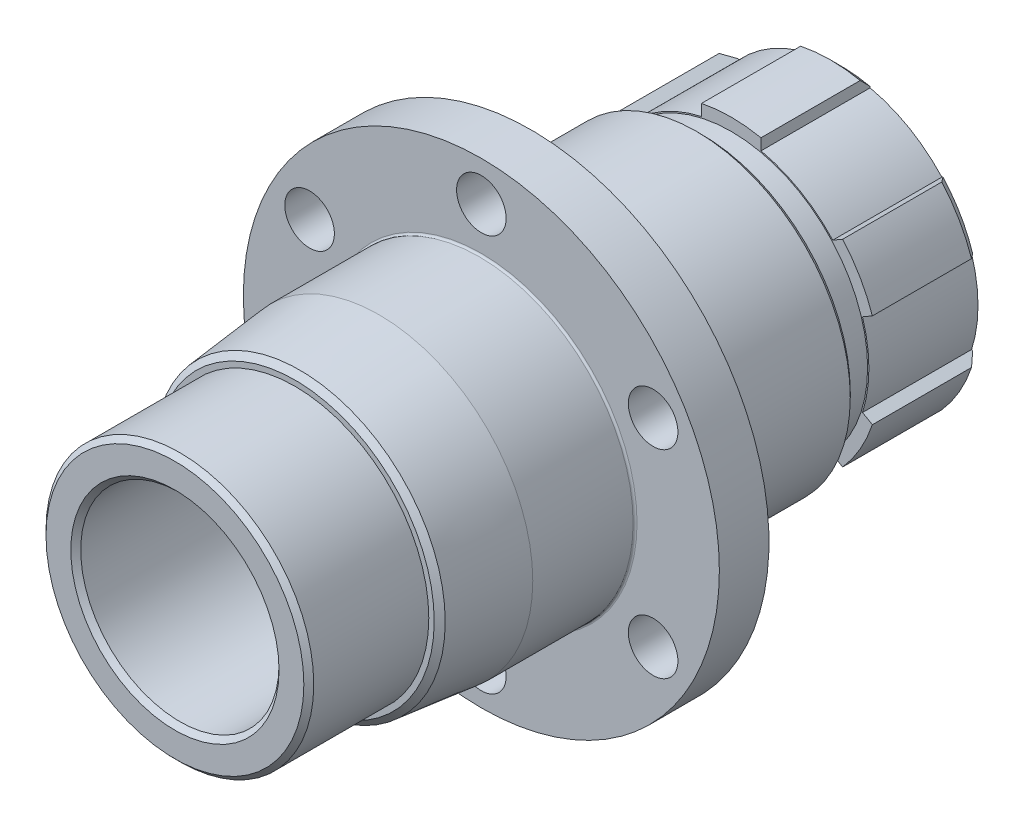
ISO-10303-21;
HEADER;
FILE_DESCRIPTION(('STEP AP214'),'2;1');
FILE_NAME('part.step','',(''),(''),'','','');
FILE_SCHEMA(('AUTOMOTIVE_DESIGN { 1 0 10303 214 1 1 1 1 }'));
ENDSEC;
DATA;
#1=APPLICATION_CONTEXT('core data for automotive mechanical design processes');
#2=APPLICATION_PROTOCOL_DEFINITION('international standard','automotive_design',2000,#1);
#3=PRODUCT_CONTEXT('',#1,'mechanical');
#4=PRODUCT('Part','Part','',(#3));
#5=PRODUCT_RELATED_PRODUCT_CATEGORY('part','',(#4));
#6=PRODUCT_DEFINITION_FORMATION('','',#4);
#7=PRODUCT_DEFINITION_CONTEXT('part definition',#1,'design');
#8=PRODUCT_DEFINITION('design','',#6,#7);
#9=PRODUCT_DEFINITION_SHAPE('','',#8);
#10=(LENGTH_UNIT() NAMED_UNIT(*) SI_UNIT(.MILLI.,.METRE.));
#11=(NAMED_UNIT(*) PLANE_ANGLE_UNIT() SI_UNIT($,.RADIAN.));
#12=(NAMED_UNIT(*) SI_UNIT($,.STERADIAN.) SOLID_ANGLE_UNIT());
#13=UNCERTAINTY_MEASURE_WITH_UNIT(LENGTH_MEASURE(1.E-05),#10,'distance_accuracy_value','');
#14=(GEOMETRIC_REPRESENTATION_CONTEXT(3) GLOBAL_UNCERTAINTY_ASSIGNED_CONTEXT((#13)) GLOBAL_UNIT_ASSIGNED_CONTEXT((#10,
#11,#12)) REPRESENTATION_CONTEXT('',''));
#15=CARTESIAN_POINT('',(0.,0.,0.));
#16=DIRECTION('',(0.,0.,1.));
#17=DIRECTION('',(1.,0.,0.));
#18=AXIS2_PLACEMENT_3D('',#15,#16,#17);
#19=CARTESIAN_POINT('',(0.,0.,55.));
#20=DIRECTION('',(0.,0.,-1.));
#21=DIRECTION('',(-1.,0.,0.));
#22=AXIS2_PLACEMENT_3D('',#19,#20,#21);
#23=CONICAL_SURFACE('',#22,14.6081237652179,0.104719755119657);
#24=CARTESIAN_POINT('',(0.,0.,54.5027390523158));
#25=DIRECTION('',(0.,0.,1.));
#26=DIRECTION('',(1.,0.,0.));
#27=AXIS2_PLACEMENT_3D('',#24,#25,#26);
#28=CIRCLE('',#27,14.6603879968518);
#29=CARTESIAN_POINT('',(14.6603879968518,0.,54.5027390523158));
#30=VERTEX_POINT('',#29);
#31=EDGE_CURVE('E562',#30,#30,#28,.F.);
#32=ORIENTED_EDGE('',*,*,#31,.T.);
#33=EDGE_LOOP('',(#32));
#34=FACE_BOUND('',#33,.T.);
#35=CARTESIAN_POINT('',(0.,0.,46.5143644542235));
#36=DIRECTION('',(0.,0.,-1.));
#37=DIRECTION('',(-1.,0.,0.));
#38=AXIS2_PLACEMENT_3D('',#35,#36,#37);
#39=CIRCLE('',#38,15.5);
#40=CARTESIAN_POINT('',(-15.5,0.,46.5143644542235));
#41=VERTEX_POINT('',#40);
#42=EDGE_CURVE('E673',#41,#41,#39,.F.);
#43=ORIENTED_EDGE('',*,*,#42,.T.);
#44=EDGE_LOOP('',(#43));
#45=FACE_BOUND('',#44,.T.);
#46=ADVANCED_FACE('F49',(#34,#45),#23,.T.);
#47=CARTESIAN_POINT('',(0.,0.,14.));
#48=DIRECTION('',(0.,0.,-1.));
#49=DIRECTION('',(-1.,0.,0.));
#50=AXIS2_PLACEMENT_3D('',#47,#48,#49);
#51=CYLINDRICAL_SURFACE('',#50,15.);
#52=CARTESIAN_POINT('',(0.,0.,0.999999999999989));
#53=DIRECTION('',(0.,0.,1.));
#54=DIRECTION('',(1.,0.,0.));
#55=AXIS2_PLACEMENT_3D('',#52,#53,#54);
#56=CIRCLE('',#55,15.);
#57=CARTESIAN_POINT('',(14.2279220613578,4.75039301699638,0.999999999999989));
#58=VERTEX_POINT('',#57);
#59=CARTESIAN_POINT('',(11.2279220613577,9.94654543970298,0.99999999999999));
#60=VERTEX_POINT('',#59);
#61=EDGE_CURVE('E908',#58,#60,#56,.T.);
#62=ORIENTED_EDGE('',*,*,#61,.T.);
#63=DIRECTION('',(0.,0.,-1.));
#64=VECTOR('',#63,1.);
#65=CARTESIAN_POINT('',(11.2279220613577,9.94654543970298,14.));
#66=LINE('',#65,#64);
#67=CARTESIAN_POINT('',(11.2279220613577,9.94654543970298,11.));
#68=VERTEX_POINT('',#67);
#69=EDGE_CURVE('E439',#60,#68,#66,.F.);
#70=ORIENTED_EDGE('',*,*,#69,.T.);
#71=CARTESIAN_POINT('',(0.,0.,11.));
#72=DIRECTION('',(0.,0.,1.));
#73=DIRECTION('',(1.,0.,0.));
#74=AXIS2_PLACEMENT_3D('',#71,#72,#73);
#75=CIRCLE('',#74,15.);
#76=CARTESIAN_POINT('',(14.2279220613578,4.75039301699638,11.));
#77=VERTEX_POINT('',#76);
#78=EDGE_CURVE('E928',#77,#68,#75,.T.);
#79=ORIENTED_EDGE('',*,*,#78,.F.);
#80=DIRECTION('',(0.,0.,-1.));
#81=VECTOR('',#80,1.);
#82=CARTESIAN_POINT('',(14.2279220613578,4.75039301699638,14.));
#83=LINE('',#82,#81);
#84=EDGE_CURVE('E427',#77,#58,#83,.T.);
#85=ORIENTED_EDGE('',*,*,#84,.T.);
#86=EDGE_LOOP('',(#62,#70,#79,#85));
#87=FACE_BOUND('',#86,.T.);
#88=ADVANCED_FACE('F655',(#87),#51,.T.);
#89=CARTESIAN_POINT('',(11.2279220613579,-9.94654543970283,0.99999999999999));
#90=VERTEX_POINT('',#89);
#91=CARTESIAN_POINT('',(14.2279220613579,-4.75039301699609,0.99999999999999));
#92=VERTEX_POINT('',#91);
#93=EDGE_CURVE('E937',#90,#92,#56,.T.);
#94=ORIENTED_EDGE('',*,*,#93,.T.);
#95=DIRECTION('',(0.,0.,-1.));
#96=VECTOR('',#95,1.);
#97=CARTESIAN_POINT('',(14.2279220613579,-4.75039301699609,14.));
#98=LINE('',#97,#96);
#99=CARTESIAN_POINT('',(14.2279220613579,-4.75039301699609,11.));
#100=VERTEX_POINT('',#99);
#101=EDGE_CURVE('E431',#92,#100,#98,.F.);
#102=ORIENTED_EDGE('',*,*,#101,.T.);
#103=CARTESIAN_POINT('',(11.2279220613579,-9.94654543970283,11.));
#104=VERTEX_POINT('',#103);
#105=EDGE_CURVE('E924',#104,#100,#75,.T.);
#106=ORIENTED_EDGE('',*,*,#105,.F.);
#107=DIRECTION('',(0.,0.,-1.));
#108=VECTOR('',#107,1.);
#109=CARTESIAN_POINT('',(11.2279220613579,-9.94654543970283,14.));
#110=LINE('',#109,#108);
#111=EDGE_CURVE('E419',#104,#90,#110,.T.);
#112=ORIENTED_EDGE('',*,*,#111,.T.);
#113=EDGE_LOOP('',(#94,#102,#106,#112));
#114=FACE_BOUND('',#113,.T.);
#115=ADVANCED_FACE('F667',(#114),#51,.T.);
#116=CARTESIAN_POINT('',(-2.9999999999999,-14.6969384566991,0.999999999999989));
#117=VERTEX_POINT('',#116);
#118=CARTESIAN_POINT('',(3.,-14.6969384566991,0.999999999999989));
#119=VERTEX_POINT('',#118);
#120=EDGE_CURVE('E940',#117,#119,#56,.T.);
#121=ORIENTED_EDGE('',*,*,#120,.T.);
#122=DIRECTION('',(0.,0.,-1.));
#123=VECTOR('',#122,1.);
#124=CARTESIAN_POINT('',(3.,-14.6969384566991,14.));
#125=LINE('',#124,#123);
#126=CARTESIAN_POINT('',(3.,-14.6969384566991,11.));
#127=VERTEX_POINT('',#126);
#128=EDGE_CURVE('E423',#119,#127,#125,.F.);
#129=ORIENTED_EDGE('',*,*,#128,.T.);
#130=CARTESIAN_POINT('',(-2.9999999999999,-14.6969384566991,11.));
#131=VERTEX_POINT('',#130);
#132=EDGE_CURVE('E921',#131,#127,#75,.T.);
#133=ORIENTED_EDGE('',*,*,#132,.F.);
#134=DIRECTION('',(0.,0.,-1.));
#135=VECTOR('',#134,1.);
#136=CARTESIAN_POINT('',(-2.9999999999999,-14.6969384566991,14.));
#137=LINE('',#136,#135);
#138=EDGE_CURVE('E412',#131,#117,#137,.T.);
#139=ORIENTED_EDGE('',*,*,#138,.T.);
#140=EDGE_LOOP('',(#121,#129,#133,#139));
#141=FACE_BOUND('',#140,.T.);
#142=ADVANCED_FACE('F948',(#141),#51,.T.);
#143=CARTESIAN_POINT('',(-14.2279220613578,-4.75039301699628,0.99999999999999));
#144=VERTEX_POINT('',#143);
#145=CARTESIAN_POINT('',(-11.2279220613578,-9.9465454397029,0.99999999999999));
#146=VERTEX_POINT('',#145);
#147=EDGE_CURVE('E520',#144,#146,#56,.T.);
#148=ORIENTED_EDGE('',*,*,#147,.T.);
#149=DIRECTION('',(0.,0.,-1.));
#150=VECTOR('',#149,1.);
#151=CARTESIAN_POINT('',(-11.2279220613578,-9.9465454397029,14.));
#152=LINE('',#151,#150);
#153=CARTESIAN_POINT('',(-11.2279220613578,-9.9465454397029,11.));
#154=VERTEX_POINT('',#153);
#155=EDGE_CURVE('E416',#146,#154,#152,.F.);
#156=ORIENTED_EDGE('',*,*,#155,.T.);
#157=CARTESIAN_POINT('',(-14.2279220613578,-4.75039301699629,11.));
#158=VERTEX_POINT('',#157);
#159=EDGE_CURVE('E276',#158,#154,#75,.T.);
#160=ORIENTED_EDGE('',*,*,#159,.F.);
#161=DIRECTION('',(0.,0.,-1.));
#162=VECTOR('',#161,1.);
#163=CARTESIAN_POINT('',(-14.2279220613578,-4.75039301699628,14.));
#164=LINE('',#163,#162);
#165=EDGE_CURVE('E394',#158,#144,#164,.T.);
#166=ORIENTED_EDGE('',*,*,#165,.T.);
#167=EDGE_LOOP('',(#148,#156,#160,#166));
#168=FACE_BOUND('',#167,.T.);
#169=ADVANCED_FACE('F919',(#168),#51,.T.);
#170=CARTESIAN_POINT('',(-11.2279220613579,9.94654543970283,0.99999999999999));
#171=VERTEX_POINT('',#170);
#172=CARTESIAN_POINT('',(-14.2279220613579,4.75039301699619,0.999999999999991));
#173=VERTEX_POINT('',#172);
#174=EDGE_CURVE('E515',#171,#173,#56,.T.);
#175=ORIENTED_EDGE('',*,*,#174,.T.);
#176=DIRECTION('',(0.,0.,-1.));
#177=VECTOR('',#176,1.);
#178=CARTESIAN_POINT('',(-14.2279220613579,4.75039301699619,14.));
#179=LINE('',#178,#177);
#180=CARTESIAN_POINT('',(-14.2279220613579,4.75039301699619,11.));
#181=VERTEX_POINT('',#180);
#182=EDGE_CURVE('E408',#173,#181,#179,.F.);
#183=ORIENTED_EDGE('',*,*,#182,.T.);
#184=CARTESIAN_POINT('',(-11.2279220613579,9.94654543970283,11.));
#185=VERTEX_POINT('',#184);
#186=EDGE_CURVE('E495',#185,#181,#75,.T.);
#187=ORIENTED_EDGE('',*,*,#186,.F.);
#188=DIRECTION('',(0.,0.,-1.));
#189=VECTOR('',#188,1.);
#190=CARTESIAN_POINT('',(-11.2279220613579,9.94654543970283,14.));
#191=LINE('',#190,#189);
#192=EDGE_CURVE('E463',#185,#171,#191,.T.);
#193=ORIENTED_EDGE('',*,*,#192,.T.);
#194=EDGE_LOOP('',(#175,#183,#187,#193));
#195=FACE_BOUND('',#194,.T.);
#196=ADVANCED_FACE('F656',(#195),#51,.T.);
#197=CARTESIAN_POINT('',(0.,0.,0.999999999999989));
#198=DIRECTION('',(0.,0.,1.));
#199=DIRECTION('',(1.,0.,0.));
#200=AXIS2_PLACEMENT_3D('',#197,#198,#199);
#201=CONICAL_SURFACE('',#200,15.,0.78539816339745);
#202=CARTESIAN_POINT('',(11.2280988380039,9.94664750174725,1.00019999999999));
#203=CARTESIAN_POINT('',(11.0806175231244,9.8614991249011,0.833335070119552));
#204=CARTESIAN_POINT('',(10.933080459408,9.77631856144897,0.66653593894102));
#205=CARTESIAN_POINT('',(10.6378948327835,9.6058930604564,0.333069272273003));
#206=CARTESIAN_POINT('',(10.4902462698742,9.52064812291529,0.166401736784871));
#207=CARTESIAN_POINT('',(10.342541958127,9.43537099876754,-0.000200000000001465));
#208=B_SPLINE_CURVE_WITH_KNOTS('',3,(#202,#203,#204,#205,#206,#207),.UNSPECIFIED.,.F.,.F.,(4,2,
4),(0.,0.715264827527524,1.43052966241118),.UNSPECIFIED.);
#209=CARTESIAN_POINT('',(10.3427192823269,9.43547337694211,0.));
#210=VERTEX_POINT('',#209);
#211=EDGE_CURVE('E770',#60,#210,#208,.T.);
#212=ORIENTED_EDGE('',*,*,#211,.F.);
#213=ORIENTED_EDGE('',*,*,#61,.F.);
#214=CARTESIAN_POINT('',(13.342541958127,4.23921857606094,-0.000199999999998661));
#215=CARTESIAN_POINT('',(13.4902462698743,4.32449570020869,0.166401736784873));
#216=CARTESIAN_POINT('',(13.6378948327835,4.4097406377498,0.333069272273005));
#217=CARTESIAN_POINT('',(13.933080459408,4.58016613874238,0.666535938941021));
#218=CARTESIAN_POINT('',(14.0806175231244,4.6653467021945,0.833335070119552));
#219=CARTESIAN_POINT('',(14.228098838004,4.75049507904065,1.00019999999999));
#220=B_SPLINE_CURVE_WITH_KNOTS('',3,(#214,#215,#216,#217,#218,#219),.UNSPECIFIED.,.F.,.F.,(4,2,
4),(0.,0.715264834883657,1.43052966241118),.UNSPECIFIED.);
#221=CARTESIAN_POINT('',(13.342719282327,4.23932095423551,0.));
#222=VERTEX_POINT('',#221);
#223=EDGE_CURVE('E777',#222,#58,#220,.T.);
#224=ORIENTED_EDGE('',*,*,#223,.F.);
#225=CARTESIAN_POINT('',(0.,0.,0.));
#226=DIRECTION('',(0.,0.,1.));
#227=DIRECTION('',(1.,0.,0.));
#228=AXIS2_PLACEMENT_3D('',#225,#226,#227);
#229=CIRCLE('',#228,14.);
#230=EDGE_CURVE('E526',#210,#222,#229,.F.);
#231=ORIENTED_EDGE('',*,*,#230,.F.);
#232=EDGE_LOOP('',(#212,#213,#224,#231));
#233=FACE_BOUND('',#232,.T.);
#234=ADVANCED_FACE('F906',(#233),#201,.T.);
#235=CARTESIAN_POINT('',(14.2280988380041,-4.75049507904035,1.00019999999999));
#236=CARTESIAN_POINT('',(14.0806175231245,-4.66534670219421,0.833335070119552));
#237=CARTESIAN_POINT('',(13.9330804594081,-4.58016613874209,0.666535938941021));
#238=CARTESIAN_POINT('',(13.6378948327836,-4.40974063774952,0.333069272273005));
#239=CARTESIAN_POINT('',(13.4902462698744,-4.32449570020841,0.166401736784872));
#240=CARTESIAN_POINT('',(13.3425419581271,-4.23921857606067,-0.000200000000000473));
#241=B_SPLINE_CURVE_WITH_KNOTS('',3,(#235,#236,#237,#238,#239,#240),.UNSPECIFIED.,.F.,.F.,(4,2,
4),(0.,0.715264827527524,1.43052966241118),.UNSPECIFIED.);
#242=CARTESIAN_POINT('',(13.3427192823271,-4.23932095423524,0.));
#243=VERTEX_POINT('',#242);
#244=EDGE_CURVE('E771',#92,#243,#241,.T.);
#245=ORIENTED_EDGE('',*,*,#244,.F.);
#246=ORIENTED_EDGE('',*,*,#93,.F.);
#247=CARTESIAN_POINT('',(10.3425419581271,-9.43537099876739,-0.000200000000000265));
#248=CARTESIAN_POINT('',(10.4902462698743,-9.52064812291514,0.166401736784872));
#249=CARTESIAN_POINT('',(10.6378948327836,-9.60589306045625,0.333069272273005));
#250=CARTESIAN_POINT('',(10.9330804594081,-9.77631856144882,0.666535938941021));
#251=CARTESIAN_POINT('',(11.0806175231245,-9.86149912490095,0.833335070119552));
#252=CARTESIAN_POINT('',(11.2280988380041,-9.94664750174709,1.00019999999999));
#253=B_SPLINE_CURVE_WITH_KNOTS('',3,(#247,#248,#249,#250,#251,#252),.UNSPECIFIED.,.F.,.F.,(4,2,
4),(0.,0.715264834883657,1.43052966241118),.UNSPECIFIED.);
#254=CARTESIAN_POINT('',(10.342719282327,-9.43547337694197,0.));
#255=VERTEX_POINT('',#254);
#256=EDGE_CURVE('E863',#255,#90,#253,.T.);
#257=ORIENTED_EDGE('',*,*,#256,.F.);
#258=EDGE_CURVE('E735',#243,#255,#229,.F.);
#259=ORIENTED_EDGE('',*,*,#258,.F.);
#260=EDGE_LOOP('',(#245,#246,#257,#259));
#261=FACE_BOUND('',#260,.T.);
#262=ADVANCED_FACE('F957',(#261),#201,.T.);
#263=CARTESIAN_POINT('',(3.,-16.4893333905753,2.76001538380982));
#264=CARTESIAN_POINT('',(3.,-16.1052677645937,2.38216275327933));
#265=CARTESIAN_POINT('',(3.,-15.721000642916,2.00451463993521));
#266=CARTESIAN_POINT('',(3.,-14.9519418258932,1.24975546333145));
#267=CARTESIAN_POINT('',(3.,-14.5671501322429,0.872644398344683));
#268=CARTESIAN_POINT('',(3.,-13.7969175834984,0.119084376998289));
#269=CARTESIAN_POINT('',(3.,-13.4114767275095,-0.25736457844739));
#270=CARTESIAN_POINT('',(3.,-12.6397461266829,-1.00939371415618));
#271=CARTESIAN_POINT('',(3.,-12.2534563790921,-1.38497389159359));
#272=CARTESIAN_POINT('',(3.,-11.8666433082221,-1.76001538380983));
#273=B_SPLINE_CURVE_WITH_KNOTS('',3,(#263,#264,#265,#266,#267,#268,#269,#270,#271,#272),
.UNSPECIFIED.,.F.,.F.,(4,2,2,2,4),(0.,1.61632663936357,3.23264806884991,4.84897172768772,
6.46530063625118),.UNSPECIFIED.);
#274=CARTESIAN_POINT('',(3.,-13.6747943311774,0.));
#275=VERTEX_POINT('',#274);
#276=EDGE_CURVE('E870',#119,#275,#273,.T.);
#277=ORIENTED_EDGE('',*,*,#276,.F.);
#278=ORIENTED_EDGE('',*,*,#120,.F.);
#279=CARTESIAN_POINT('',(-2.99999999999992,-11.8666433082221,-1.76001538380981));
#280=CARTESIAN_POINT('',(-2.99999999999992,-12.2534563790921,-1.38497389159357));
#281=CARTESIAN_POINT('',(-2.99999999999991,-12.6397461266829,-1.00939371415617));
#282=CARTESIAN_POINT('',(-2.99999999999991,-13.4114767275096,-0.257364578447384));
#283=CARTESIAN_POINT('',(-2.9999999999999,-13.7969175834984,0.119084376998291));
#284=CARTESIAN_POINT('',(-2.9999999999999,-14.567150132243,0.872644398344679));
#285=CARTESIAN_POINT('',(-2.9999999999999,-14.9519418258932,1.24975546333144));
#286=CARTESIAN_POINT('',(-2.99999999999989,-15.721000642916,2.00451463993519));
#287=CARTESIAN_POINT('',(-2.99999999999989,-16.1052677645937,2.38216275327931));
#288=CARTESIAN_POINT('',(-2.99999999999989,-16.4893333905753,2.7600153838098));
#289=B_SPLINE_CURVE_WITH_KNOTS('',3,(#279,#280,#281,#282,#283,#284,#285,#286,#287,#288),
.UNSPECIFIED.,.F.,.F.,(4,2,2,2,4),(0.,1.61632890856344,3.23265256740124,4.84897399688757,
6.46530063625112),.UNSPECIFIED.);
#290=CARTESIAN_POINT('',(-2.99999999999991,-13.6747943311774,0.));
#291=VERTEX_POINT('',#290);
#292=EDGE_CURVE('E829',#291,#117,#289,.T.);
#293=ORIENTED_EDGE('',*,*,#292,.F.);
#294=EDGE_CURVE('E730',#275,#291,#229,.F.);
#295=ORIENTED_EDGE('',*,*,#294,.F.);
#296=EDGE_LOOP('',(#277,#278,#293,#295));
#297=FACE_BOUND('',#296,.T.);
#298=ADVANCED_FACE('F949',(#297),#201,.T.);
#299=CARTESIAN_POINT('',(-11.228098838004,-9.94664750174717,1.00019999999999));
#300=CARTESIAN_POINT('',(-11.0806175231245,-9.86149912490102,0.833335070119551));
#301=CARTESIAN_POINT('',(-10.933080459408,-9.7763185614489,0.66653593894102));
#302=CARTESIAN_POINT('',(-10.6378948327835,-9.60589306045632,0.333069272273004));
#303=CARTESIAN_POINT('',(-10.4902462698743,-9.52064812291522,0.166401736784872));
#304=CARTESIAN_POINT('',(-10.342541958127,-9.43537099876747,-0.00020000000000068));
#305=B_SPLINE_CURVE_WITH_KNOTS('',3,(#299,#300,#301,#302,#303,#304),.UNSPECIFIED.,.F.,.F.,(4,2,
4),(0.,0.715264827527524,1.43052966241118),.UNSPECIFIED.);
#306=CARTESIAN_POINT('',(-10.342719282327,-9.43547337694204,0.));
#307=VERTEX_POINT('',#306);
#308=EDGE_CURVE('E837',#146,#307,#305,.T.);
#309=ORIENTED_EDGE('',*,*,#308,.F.);
#310=ORIENTED_EDGE('',*,*,#147,.F.);
#311=CARTESIAN_POINT('',(-13.3425419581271,-4.23921857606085,-0.000199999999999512));
#312=CARTESIAN_POINT('',(-13.4902462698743,-4.3244957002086,0.166401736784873));
#313=CARTESIAN_POINT('',(-13.6378948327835,-4.40974063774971,0.333069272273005));
#314=CARTESIAN_POINT('',(-13.9330804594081,-4.58016613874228,0.666535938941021));
#315=CARTESIAN_POINT('',(-14.0806175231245,-4.6653467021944,0.833335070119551));
#316=CARTESIAN_POINT('',(-14.228098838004,-4.75049507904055,1.00019999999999));
#317=B_SPLINE_CURVE_WITH_KNOTS('',3,(#311,#312,#313,#314,#315,#316),.UNSPECIFIED.,.F.,.F.,(4,2,
4),(0.,0.715264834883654,1.43052966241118),.UNSPECIFIED.);
#318=CARTESIAN_POINT('',(-13.342719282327,-4.23932095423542,0.));
#319=VERTEX_POINT('',#318);
#320=EDGE_CURVE('E816',#319,#144,#317,.T.);
#321=ORIENTED_EDGE('',*,*,#320,.F.);
#322=EDGE_CURVE('E736',#307,#319,#229,.F.);
#323=ORIENTED_EDGE('',*,*,#322,.F.);
#324=EDGE_LOOP('',(#309,#310,#321,#323));
#325=FACE_BOUND('',#324,.T.);
#326=ADVANCED_FACE('F917',(#325),#201,.T.);
#327=CARTESIAN_POINT('',(-14.2280988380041,4.75049507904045,1.00019999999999));
#328=CARTESIAN_POINT('',(-14.0806175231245,4.66534670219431,0.833335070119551));
#329=CARTESIAN_POINT('',(-13.9330804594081,4.58016613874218,0.666535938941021));
#330=CARTESIAN_POINT('',(-13.6378948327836,4.40974063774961,0.333069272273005));
#331=CARTESIAN_POINT('',(-13.4902462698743,4.32449570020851,0.166401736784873));
#332=CARTESIAN_POINT('',(-13.3425419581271,4.23921857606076,-0.000199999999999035));
#333=B_SPLINE_CURVE_WITH_KNOTS('',3,(#327,#328,#329,#330,#331,#332),.UNSPECIFIED.,.F.,.F.,(4,2,
4),(0.,0.715264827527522,1.43052966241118),.UNSPECIFIED.);
#334=CARTESIAN_POINT('',(-13.342719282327,4.23932095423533,0.));
#335=VERTEX_POINT('',#334);
#336=EDGE_CURVE('E754',#173,#335,#333,.T.);
#337=ORIENTED_EDGE('',*,*,#336,.F.);
#338=ORIENTED_EDGE('',*,*,#174,.F.);
#339=CARTESIAN_POINT('',(-10.3425419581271,9.43537099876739,-0.000200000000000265));
#340=CARTESIAN_POINT('',(-10.4902462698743,9.52064812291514,0.166401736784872));
#341=CARTESIAN_POINT('',(-10.6378948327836,9.60589306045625,0.333069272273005));
#342=CARTESIAN_POINT('',(-10.9330804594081,9.77631856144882,0.666535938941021));
#343=CARTESIAN_POINT('',(-11.0806175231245,9.86149912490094,0.833335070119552));
#344=CARTESIAN_POINT('',(-11.2280988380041,9.94664750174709,1.00019999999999));
#345=B_SPLINE_CURVE_WITH_KNOTS('',3,(#339,#340,#341,#342,#343,#344),.UNSPECIFIED.,.F.,.F.,(4,2,
4),(0.,0.715264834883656,1.43052966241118),.UNSPECIFIED.);
#346=CARTESIAN_POINT('',(-10.342719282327,9.43547337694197,0.));
#347=VERTEX_POINT('',#346);
#348=EDGE_CURVE('E566',#347,#171,#345,.T.);
#349=ORIENTED_EDGE('',*,*,#348,.F.);
#350=EDGE_CURVE('E519',#335,#347,#229,.F.);
#351=ORIENTED_EDGE('',*,*,#350,.F.);
#352=EDGE_LOOP('',(#337,#338,#349,#351));
#353=FACE_BOUND('',#352,.T.);
#354=ADVANCED_FACE('F753',(#353),#201,.T.);
#355=CARTESIAN_POINT('',(0.,0.,0.));
#356=DIRECTION('',(0.,0.,1.));
#357=DIRECTION('',(1.,0.,0.));
#358=AXIS2_PLACEMENT_3D('',#355,#356,#357);
#359=CYLINDRICAL_SURFACE('',#358,10.);
#360=CARTESIAN_POINT('',(0.,0.,0.499999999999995));
#361=DIRECTION('',(0.,0.,1.));
#362=DIRECTION('',(1.,0.,0.));
#363=AXIS2_PLACEMENT_3D('',#360,#361,#362);
#364=CIRCLE('',#363,10.);
#365=CARTESIAN_POINT('',(10.,0.,0.499999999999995));
#366=VERTEX_POINT('',#365);
#367=EDGE_CURVE('E538',#366,#366,#364,.F.);
#368=ORIENTED_EDGE('',*,*,#367,.T.);
#369=EDGE_LOOP('',(#368));
#370=FACE_BOUND('',#369,.T.);
#371=CARTESIAN_POINT('',(0.,0.,16.1));
#372=DIRECTION('',(0.,0.,1.));
#373=DIRECTION('',(1.,0.,0.));
#374=AXIS2_PLACEMENT_3D('',#371,#372,#373);
#375=CIRCLE('',#374,10.);
#376=CARTESIAN_POINT('',(10.,0.,16.1));
#377=VERTEX_POINT('',#376);
#378=EDGE_CURVE('E505',#377,#377,#375,.F.);
#379=ORIENTED_EDGE('',*,*,#378,.F.);
#380=EDGE_LOOP('',(#379));
#381=FACE_BOUND('',#380,.T.);
#382=ADVANCED_FACE('F622',(#370,#381),#359,.F.);
#383=CARTESIAN_POINT('',(2.9999999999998,14.6969384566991,11.));
#384=VERTEX_POINT('',#383);
#385=CARTESIAN_POINT('',(-3.,14.6969384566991,11.));
#386=VERTEX_POINT('',#385);
#387=EDGE_CURVE('E500',#384,#386,#75,.T.);
#388=ORIENTED_EDGE('',*,*,#387,.F.);
#389=DIRECTION('',(0.,0.,-1.));
#390=VECTOR('',#389,1.);
#391=CARTESIAN_POINT('',(2.9999999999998,14.6969384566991,14.));
#392=LINE('',#391,#390);
#393=CARTESIAN_POINT('',(2.9999999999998,14.6969384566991,0.999999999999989));
#394=VERTEX_POINT('',#393);
#395=EDGE_CURVE('E435',#384,#394,#392,.T.);
#396=ORIENTED_EDGE('',*,*,#395,.T.);
#397=CARTESIAN_POINT('',(-3.,14.6969384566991,0.999999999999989));
#398=VERTEX_POINT('',#397);
#399=EDGE_CURVE('E494',#394,#398,#56,.T.);
#400=ORIENTED_EDGE('',*,*,#399,.T.);
#401=DIRECTION('',(0.,0.,-1.));
#402=VECTOR('',#401,1.);
#403=CARTESIAN_POINT('',(-3.,14.6969384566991,14.));
#404=LINE('',#403,#402);
#405=EDGE_CURVE('E477',#398,#386,#404,.F.);
#406=ORIENTED_EDGE('',*,*,#405,.T.);
#407=EDGE_LOOP('',(#388,#396,#400,#406));
#408=FACE_BOUND('',#407,.T.);
#409=ADVANCED_FACE('F651',(#408),#51,.T.);
#410=CARTESIAN_POINT('',(0.,0.,0.));
#411=DIRECTION('',(0.,0.,1.));
#412=DIRECTION('',(1.,0.,0.));
#413=AXIS2_PLACEMENT_3D('',#410,#411,#412);
#414=PLANE('',#413);
#415=CARTESIAN_POINT('',(0.,0.,0.));
#416=DIRECTION('',(0.,0.,1.));
#417=DIRECTION('',(1.,0.,0.));
#418=AXIS2_PLACEMENT_3D('',#415,#416,#417);
#419=CIRCLE('',#418,10.5);
#420=CARTESIAN_POINT('',(10.5,0.,0.));
#421=VERTEX_POINT('',#420);
#422=EDGE_CURVE('E534',#421,#421,#419,.T.);
#423=ORIENTED_EDGE('',*,*,#422,.T.);
#424=EDGE_LOOP('',(#423));
#425=FACE_BOUND('',#424,.T.);
#426=CARTESIAN_POINT('',(0.,0.,0.));
#427=DIRECTION('',(0.,0.,1.));
#428=DIRECTION('',(0.50000000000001,-0.866025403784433,0.));
#429=AXIS2_PLACEMENT_3D('',#426,#427,#428);
#430=CIRCLE('',#429,13.88);
#431=CARTESIAN_POINT('',(10.2363026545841,9.37403370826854,0.));
#432=VERTEX_POINT('',#431);
#433=CARTESIAN_POINT('',(2.99999999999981,13.5519149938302,0.));
#434=VERTEX_POINT('',#433);
#435=EDGE_CURVE('E354',#432,#434,#430,.T.);
#436=ORIENTED_EDGE('',*,*,#435,.F.);
#437=DIRECTION('',(-0.866025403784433,-0.50000000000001,0.));
#438=VECTOR('',#437,1.);
#439=CARTESIAN_POINT('',(15.280230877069,12.2861470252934,0.));
#440=LINE('',#439,#438);
#441=EDGE_CURVE('E358',#210,#432,#440,.T.);
#442=ORIENTED_EDGE('',*,*,#441,.F.);
#443=ORIENTED_EDGE('',*,*,#230,.T.);
#444=DIRECTION('',(0.866025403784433,0.50000000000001,0.));
#445=VECTOR('',#444,1.);
#446=CARTESIAN_POINT('',(13.2363026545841,4.17788128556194,0.));
#447=LINE('',#446,#445);
#448=CARTESIAN_POINT('',(13.2363026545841,4.17788128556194,0.));
#449=VERTEX_POINT('',#448);
#450=EDGE_CURVE('E321',#449,#222,#447,.T.);
#451=ORIENTED_EDGE('',*,*,#450,.F.);
#452=CARTESIAN_POINT('',(0.,0.,0.));
#453=DIRECTION('',(0.,0.,1.));
#454=DIRECTION('',(-0.499999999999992,-0.866025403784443,0.));
#455=AXIS2_PLACEMENT_3D('',#452,#453,#454);
#456=CIRCLE('',#455,13.88);
#457=CARTESIAN_POINT('',(13.2363026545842,-4.17788128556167,0.));
#458=VERTEX_POINT('',#457);
#459=EDGE_CURVE('E325',#458,#449,#456,.T.);
#460=ORIENTED_EDGE('',*,*,#459,.F.);
#461=DIRECTION('',(-0.866025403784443,0.499999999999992,0.));
#462=VECTOR('',#461,1.);
#463=CARTESIAN_POINT('',(18.2802308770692,-7.08999460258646,0.));
#464=LINE('',#463,#462);
#465=EDGE_CURVE('E329',#243,#458,#464,.T.);
#466=ORIENTED_EDGE('',*,*,#465,.F.);
#467=ORIENTED_EDGE('',*,*,#258,.T.);
#468=DIRECTION('',(0.86602540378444,-0.499999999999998,0.));
#469=VECTOR('',#468,1.);
#470=CARTESIAN_POINT('',(10.2363026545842,-9.3740337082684,0.));
#471=LINE('',#470,#469);
#472=CARTESIAN_POINT('',(10.2363026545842,-9.3740337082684,0.));
#473=VERTEX_POINT('',#472);
#474=EDGE_CURVE('E291',#473,#255,#471,.T.);
#475=ORIENTED_EDGE('',*,*,#474,.F.);
#476=CARTESIAN_POINT('',(0.,0.,0.));
#477=DIRECTION('',(0.,0.,1.));
#478=DIRECTION('',(-1.,0.,0.));
#479=AXIS2_PLACEMENT_3D('',#476,#477,#478);
#480=CIRCLE('',#479,13.88);
#481=CARTESIAN_POINT('',(3.,-13.5519149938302,0.));
#482=VERTEX_POINT('',#481);
#483=EDGE_CURVE('E295',#482,#473,#480,.T.);
#484=ORIENTED_EDGE('',*,*,#483,.F.);
#485=DIRECTION('',(0.,1.,0.));
#486=VECTOR('',#485,1.);
#487=CARTESIAN_POINT('',(3.,-19.3761416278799,0.));
#488=LINE('',#487,#486);
#489=EDGE_CURVE('E299',#275,#482,#488,.T.);
#490=ORIENTED_EDGE('',*,*,#489,.F.);
#491=ORIENTED_EDGE('',*,*,#294,.T.);
#492=DIRECTION('',(0.,-1.,0.));
#493=VECTOR('',#492,1.);
#494=CARTESIAN_POINT('',(-2.99999999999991,-13.5519149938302,0.));
#495=LINE('',#494,#493);
#496=CARTESIAN_POINT('',(-2.99999999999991,-13.5519149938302,0.));
#497=VERTEX_POINT('',#496);
#498=EDGE_CURVE('E75',#497,#291,#495,.T.);
#499=ORIENTED_EDGE('',*,*,#498,.F.);
#500=CARTESIAN_POINT('',(0.,0.,0.));
#501=DIRECTION('',(0.,0.,1.));
#502=DIRECTION('',(-0.500000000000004,0.866025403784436,0.));
#503=AXIS2_PLACEMENT_3D('',#500,#501,#502);
#504=CIRCLE('',#503,13.88);
#505=CARTESIAN_POINT('',(-10.2363026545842,-9.37403370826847,0.));
#506=VERTEX_POINT('',#505);
#507=EDGE_CURVE('E280',#506,#497,#504,.T.);
#508=ORIENTED_EDGE('',*,*,#507,.F.);
#509=DIRECTION('',(0.866025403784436,0.500000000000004,0.));
#510=VECTOR('',#509,1.);
#511=CARTESIAN_POINT('',(-15.2802308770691,-12.2861470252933,0.));
#512=LINE('',#511,#510);
#513=EDGE_CURVE('E267',#307,#506,#512,.T.);
#514=ORIENTED_EDGE('',*,*,#513,.F.);
#515=ORIENTED_EDGE('',*,*,#322,.T.);
#516=DIRECTION('',(-0.866025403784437,-0.500000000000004,0.));
#517=VECTOR('',#516,1.);
#518=CARTESIAN_POINT('',(-13.2363026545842,-4.17788128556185,0.));
#519=LINE('',#518,#517);
#520=CARTESIAN_POINT('',(-13.2363026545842,-4.17788128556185,0.));
#521=VERTEX_POINT('',#520);
#522=EDGE_CURVE('E67',#521,#319,#519,.T.);
#523=ORIENTED_EDGE('',*,*,#522,.F.);
#524=CARTESIAN_POINT('',(0.,0.,0.));
#525=DIRECTION('',(0.,0.,1.));
#526=DIRECTION('',(0.499999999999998,0.86602540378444,0.));
#527=AXIS2_PLACEMENT_3D('',#524,#525,#526);
#528=CIRCLE('',#527,13.88);
#529=CARTESIAN_POINT('',(-13.2363026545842,4.17788128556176,0.));
#530=VERTEX_POINT('',#529);
#531=EDGE_CURVE('E381',#530,#521,#528,.T.);
#532=ORIENTED_EDGE('',*,*,#531,.F.);
#533=DIRECTION('',(0.86602540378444,-0.499999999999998,0.));
#534=VECTOR('',#533,1.);
#535=CARTESIAN_POINT('',(-18.2802308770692,7.08999460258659,0.));
#536=LINE('',#535,#534);
#537=EDGE_CURVE('E287',#335,#530,#536,.T.);
#538=ORIENTED_EDGE('',*,*,#537,.F.);
#539=ORIENTED_EDGE('',*,*,#350,.T.);
#540=DIRECTION('',(-0.86602540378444,0.499999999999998,0.));
#541=VECTOR('',#540,1.);
#542=CARTESIAN_POINT('',(-10.2363026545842,9.3740337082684,0.));
#543=LINE('',#542,#541);
#544=CARTESIAN_POINT('',(-10.2363026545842,9.3740337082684,0.));
#545=VERTEX_POINT('',#544);
#546=EDGE_CURVE('E444',#545,#347,#543,.T.);
#547=ORIENTED_EDGE('',*,*,#546,.F.);
#548=CARTESIAN_POINT('',(0.,0.,0.));
#549=DIRECTION('',(0.,0.,1.));
#550=DIRECTION('',(1.,0.,0.));
#551=AXIS2_PLACEMENT_3D('',#548,#549,#550);
#552=CIRCLE('',#551,13.88);
#553=CARTESIAN_POINT('',(-3.,13.5519149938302,0.));
#554=VERTEX_POINT('',#553);
#555=EDGE_CURVE('E449',#554,#545,#552,.T.);
#556=ORIENTED_EDGE('',*,*,#555,.F.);
#557=DIRECTION('',(0.,-1.,0.));
#558=VECTOR('',#557,1.);
#559=CARTESIAN_POINT('',(-3.,19.3761416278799,0.));
#560=LINE('',#559,#558);
#561=CARTESIAN_POINT('',(-3.,13.6747943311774,0.));
#562=VERTEX_POINT('',#561);
#563=EDGE_CURVE('E443',#562,#554,#560,.T.);
#564=ORIENTED_EDGE('',*,*,#563,.F.);
#565=CARTESIAN_POINT('',(2.99999999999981,13.6747943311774,0.));
#566=VERTEX_POINT('',#565);
#567=EDGE_CURVE('E521',#562,#566,#229,.F.);
#568=ORIENTED_EDGE('',*,*,#567,.T.);
#569=DIRECTION('',(0.,1.,0.));
#570=VECTOR('',#569,1.);
#571=CARTESIAN_POINT('',(2.99999999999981,13.5519149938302,0.));
#572=LINE('',#571,#570);
#573=EDGE_CURVE('E350',#434,#566,#572,.T.);
#574=ORIENTED_EDGE('',*,*,#573,.F.);
#575=EDGE_LOOP('',(#436,#442,#443,#451,#460,#466,#467,#475,#484,#490,#491,#499,#508,#514,#515,
#523,#532,#538,#539,#547,#556,#564,#568,#574));
#576=FACE_BOUND('',#575,.T.);
#577=ADVANCED_FACE('F648',(#425,#576),#414,.F.);
#578=CARTESIAN_POINT('',(0.,0.,11.));
#579=DIRECTION('',(0.,0.,1.));
#580=DIRECTION('',(1.,0.,0.));
#581=AXIS2_PLACEMENT_3D('',#578,#579,#580);
#582=PLANE('',#581);
#583=DIRECTION('',(-0.866025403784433,-0.50000000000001,0.));
#584=VECTOR('',#583,1.);
#585=CARTESIAN_POINT('',(15.280230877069,12.2861470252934,11.));
#586=LINE('',#585,#584);
#587=CARTESIAN_POINT('',(10.2363026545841,9.37403370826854,11.));
#588=VERTEX_POINT('',#587);
#589=EDGE_CURVE('E353',#68,#588,#586,.T.);
#590=ORIENTED_EDGE('',*,*,#589,.T.);
#591=CARTESIAN_POINT('',(0.,0.,11.));
#592=DIRECTION('',(0.,0.,1.));
#593=DIRECTION('',(1.,0.,0.));
#594=AXIS2_PLACEMENT_3D('',#591,#592,#593);
#595=CIRCLE('',#594,13.88);
#596=CARTESIAN_POINT('',(2.99999999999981,13.5519149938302,11.));
#597=VERTEX_POINT('',#596);
#598=EDGE_CURVE('E369',#588,#597,#595,.T.);
#599=ORIENTED_EDGE('',*,*,#598,.T.);
#600=DIRECTION('',(0.,1.,0.));
#601=VECTOR('',#600,1.);
#602=CARTESIAN_POINT('',(2.99999999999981,13.5519149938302,11.));
#603=LINE('',#602,#601);
#604=EDGE_CURVE('E332',#597,#384,#603,.T.);
#605=ORIENTED_EDGE('',*,*,#604,.T.);
#606=ORIENTED_EDGE('',*,*,#387,.T.);
#607=DIRECTION('',(0.,-1.,0.));
#608=VECTOR('',#607,1.);
#609=CARTESIAN_POINT('',(-3.,19.3761416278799,11.));
#610=LINE('',#609,#608);
#611=CARTESIAN_POINT('',(-3.,13.5519149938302,11.));
#612=VERTEX_POINT('',#611);
#613=EDGE_CURVE('E448',#386,#612,#610,.T.);
#614=ORIENTED_EDGE('',*,*,#613,.T.);
#615=CARTESIAN_POINT('',(0.,0.,11.));
#616=DIRECTION('',(0.,0.,1.));
#617=DIRECTION('',(1.,0.,0.));
#618=AXIS2_PLACEMENT_3D('',#615,#616,#617);
#619=CIRCLE('',#618,13.88);
#620=CARTESIAN_POINT('',(-10.2363026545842,9.3740337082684,11.));
#621=VERTEX_POINT('',#620);
#622=EDGE_CURVE('E465',#612,#621,#619,.T.);
#623=ORIENTED_EDGE('',*,*,#622,.T.);
#624=DIRECTION('',(-0.86602540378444,0.499999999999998,0.));
#625=VECTOR('',#624,1.);
#626=CARTESIAN_POINT('',(-10.2363026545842,9.3740337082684,11.));
#627=LINE('',#626,#625);
#628=EDGE_CURVE('E459',#621,#185,#627,.T.);
#629=ORIENTED_EDGE('',*,*,#628,.T.);
#630=ORIENTED_EDGE('',*,*,#186,.T.);
#631=DIRECTION('',(0.86602540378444,-0.499999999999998,0.));
#632=VECTOR('',#631,1.);
#633=CARTESIAN_POINT('',(-18.2802308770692,7.08999460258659,11.));
#634=LINE('',#633,#632);
#635=CARTESIAN_POINT('',(-13.2363026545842,4.17788128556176,11.));
#636=VERTEX_POINT('',#635);
#637=EDGE_CURVE('E380',#181,#636,#634,.T.);
#638=ORIENTED_EDGE('',*,*,#637,.T.);
#639=CARTESIAN_POINT('',(0.,0.,11.));
#640=DIRECTION('',(0.,0.,1.));
#641=DIRECTION('',(1.,0.,0.));
#642=AXIS2_PLACEMENT_3D('',#639,#640,#641);
#643=CIRCLE('',#642,13.88);
#644=CARTESIAN_POINT('',(-13.2363026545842,-4.17788128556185,11.));
#645=VERTEX_POINT('',#644);
#646=EDGE_CURVE('E396',#636,#645,#643,.T.);
#647=ORIENTED_EDGE('',*,*,#646,.T.);
#648=DIRECTION('',(-0.866025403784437,-0.500000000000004,0.));
#649=VECTOR('',#648,1.);
#650=CARTESIAN_POINT('',(-13.2363026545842,-4.17788128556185,11.));
#651=LINE('',#650,#649);
#652=EDGE_CURVE('E391',#645,#158,#651,.T.);
#653=ORIENTED_EDGE('',*,*,#652,.T.);
#654=ORIENTED_EDGE('',*,*,#159,.T.);
#655=DIRECTION('',(0.866025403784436,0.500000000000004,0.));
#656=VECTOR('',#655,1.);
#657=CARTESIAN_POINT('',(-15.2802308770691,-12.2861470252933,11.));
#658=LINE('',#657,#656);
#659=CARTESIAN_POINT('',(-10.2363026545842,-9.37403370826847,11.));
#660=VERTEX_POINT('',#659);
#661=EDGE_CURVE('E264',#154,#660,#658,.T.);
#662=ORIENTED_EDGE('',*,*,#661,.T.);
#663=CARTESIAN_POINT('',(0.,0.,11.));
#664=DIRECTION('',(0.,0.,1.));
#665=DIRECTION('',(1.,0.,0.));
#666=AXIS2_PLACEMENT_3D('',#663,#664,#665);
#667=CIRCLE('',#666,13.88);
#668=CARTESIAN_POINT('',(-2.9999999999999,-13.5519149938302,11.));
#669=VERTEX_POINT('',#668);
#670=EDGE_CURVE('E250',#660,#669,#667,.T.);
#671=ORIENTED_EDGE('',*,*,#670,.T.);
#672=DIRECTION('',(0.,-1.,0.));
#673=VECTOR('',#672,1.);
#674=CARTESIAN_POINT('',(-2.99999999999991,-13.5519149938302,11.));
#675=LINE('',#674,#673);
#676=EDGE_CURVE('E285',#669,#131,#675,.T.);
#677=ORIENTED_EDGE('',*,*,#676,.T.);
#678=ORIENTED_EDGE('',*,*,#132,.T.);
#679=DIRECTION('',(0.,1.,0.));
#680=VECTOR('',#679,1.);
#681=CARTESIAN_POINT('',(3.,-19.3761416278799,11.));
#682=LINE('',#681,#680);
#683=CARTESIAN_POINT('',(3.,-13.5519149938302,11.));
#684=VERTEX_POINT('',#683);
#685=EDGE_CURVE('E294',#127,#684,#682,.T.);
#686=ORIENTED_EDGE('',*,*,#685,.T.);
#687=CARTESIAN_POINT('',(0.,0.,11.));
#688=DIRECTION('',(0.,0.,1.));
#689=DIRECTION('',(1.,0.,0.));
#690=AXIS2_PLACEMENT_3D('',#687,#688,#689);
#691=CIRCLE('',#690,13.88);
#692=CARTESIAN_POINT('',(10.2363026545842,-9.3740337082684,11.));
#693=VERTEX_POINT('',#692);
#694=EDGE_CURVE('E312',#684,#693,#691,.T.);
#695=ORIENTED_EDGE('',*,*,#694,.T.);
#696=DIRECTION('',(0.86602540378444,-0.499999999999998,0.));
#697=VECTOR('',#696,1.);
#698=CARTESIAN_POINT('',(10.2363026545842,-9.3740337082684,11.));
#699=LINE('',#698,#697);
#700=EDGE_CURVE('E307',#693,#104,#699,.T.);
#701=ORIENTED_EDGE('',*,*,#700,.T.);
#702=ORIENTED_EDGE('',*,*,#105,.T.);
#703=DIRECTION('',(-0.866025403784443,0.499999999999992,0.));
#704=VECTOR('',#703,1.);
#705=CARTESIAN_POINT('',(18.2802308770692,-7.08999460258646,11.));
#706=LINE('',#705,#704);
#707=CARTESIAN_POINT('',(13.2363026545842,-4.17788128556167,11.));
#708=VERTEX_POINT('',#707);
#709=EDGE_CURVE('E324',#100,#708,#706,.T.);
#710=ORIENTED_EDGE('',*,*,#709,.T.);
#711=CARTESIAN_POINT('',(0.,0.,11.));
#712=DIRECTION('',(0.,0.,1.));
#713=DIRECTION('',(1.,0.,0.));
#714=AXIS2_PLACEMENT_3D('',#711,#712,#713);
#715=CIRCLE('',#714,13.88);
#716=CARTESIAN_POINT('',(13.2363026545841,4.17788128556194,11.));
#717=VERTEX_POINT('',#716);
#718=EDGE_CURVE('E341',#708,#717,#715,.T.);
#719=ORIENTED_EDGE('',*,*,#718,.T.);
#720=DIRECTION('',(0.866025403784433,0.50000000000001,0.));
#721=VECTOR('',#720,1.);
#722=CARTESIAN_POINT('',(13.2363026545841,4.17788128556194,11.));
#723=LINE('',#722,#721);
#724=EDGE_CURVE('E302',#717,#77,#723,.T.);
#725=ORIENTED_EDGE('',*,*,#724,.T.);
#726=ORIENTED_EDGE('',*,*,#78,.T.);
#727=EDGE_LOOP('',(#590,#599,#605,#606,#614,#623,#629,#630,#638,#647,#653,#654,#662,#671,#677,
#678,#686,#695,#701,#702,#710,#719,#725,#726));
#728=FACE_BOUND('',#727,.T.);
#729=CARTESIAN_POINT('',(0.,0.,11.));
#730=DIRECTION('',(0.,0.,1.));
#731=DIRECTION('',(1.,0.,0.));
#732=AXIS2_PLACEMENT_3D('',#729,#730,#731);
#733=CIRCLE('',#732,13.75);
#734=CARTESIAN_POINT('',(13.75,0.,11.));
#735=VERTEX_POINT('',#734);
#736=EDGE_CURVE('E496',#735,#735,#733,.T.);
#737=ORIENTED_EDGE('',*,*,#736,.F.);
#738=EDGE_LOOP('',(#737));
#739=FACE_BOUND('',#738,.T.);
#740=ADVANCED_FACE('F272',(#728,#739),#582,.T.);
#741=CARTESIAN_POINT('',(0.,0.,11.));
#742=DIRECTION('',(0.,0.,1.));
#743=DIRECTION('',(1.,0.,0.));
#744=AXIS2_PLACEMENT_3D('',#741,#742,#743);
#745=CYLINDRICAL_SURFACE('',#744,13.75);
#746=ORIENTED_EDGE('',*,*,#736,.T.);
#747=EDGE_LOOP('',(#746));
#748=FACE_BOUND('',#747,.T.);
#749=CARTESIAN_POINT('',(0.,0.,14.));
#750=DIRECTION('',(0.,0.,1.));
#751=DIRECTION('',(1.,0.,0.));
#752=AXIS2_PLACEMENT_3D('',#749,#750,#751);
#753=CIRCLE('',#752,13.75);
#754=CARTESIAN_POINT('',(13.75,0.,14.));
#755=VERTEX_POINT('',#754);
#756=EDGE_CURVE('E501',#755,#755,#753,.T.);
#757=ORIENTED_EDGE('',*,*,#756,.F.);
#758=EDGE_LOOP('',(#757));
#759=FACE_BOUND('',#758,.T.);
#760=ADVANCED_FACE('F641',(#748,#759),#745,.T.);
#761=CARTESIAN_POINT('',(0.,0.,25.5));
#762=DIRECTION('',(0.,0.,-1.));
#763=DIRECTION('',(-1.,0.,0.));
#764=AXIS2_PLACEMENT_3D('',#761,#762,#763);
#765=CYLINDRICAL_SURFACE('',#764,15.5);
#766=CARTESIAN_POINT('',(0.,0.,31.));
#767=DIRECTION('',(0.,0.,1.));
#768=DIRECTION('',(1.,0.,0.));
#769=AXIS2_PLACEMENT_3D('',#766,#767,#768);
#770=CIRCLE('',#769,15.5);
#771=CARTESIAN_POINT('',(15.5,0.,31.));
#772=VERTEX_POINT('',#771);
#773=EDGE_CURVE('E688',#772,#772,#770,.F.);
#774=ORIENTED_EDGE('',*,*,#773,.T.);
#775=EDGE_LOOP('',(#774));
#776=FACE_BOUND('',#775,.T.);
#777=CARTESIAN_POINT('',(0.,0.,14.5));
#778=DIRECTION('',(0.,0.,1.));
#779=DIRECTION('',(1.,0.,0.));
#780=AXIS2_PLACEMENT_3D('',#777,#778,#779);
#781=CIRCLE('',#780,15.5);
#782=CARTESIAN_POINT('',(15.5,0.,14.5));
#783=VERTEX_POINT('',#782);
#784=EDGE_CURVE('E525',#783,#783,#781,.T.);
#785=ORIENTED_EDGE('',*,*,#784,.T.);
#786=EDGE_LOOP('',(#785));
#787=FACE_BOUND('',#786,.T.);
#788=ADVANCED_FACE('F637',(#776,#787),#765,.T.);
#789=CARTESIAN_POINT('',(0.,0.,14.));
#790=DIRECTION('',(0.,0.,1.));
#791=DIRECTION('',(1.,0.,0.));
#792=AXIS2_PLACEMENT_3D('',#789,#790,#791);
#793=PLANE('',#792);
#794=CARTESIAN_POINT('',(0.,0.,14.));
#795=DIRECTION('',(0.,0.,1.));
#796=DIRECTION('',(1.,0.,0.));
#797=AXIS2_PLACEMENT_3D('',#794,#795,#796);
#798=CIRCLE('',#797,15.);
#799=CARTESIAN_POINT('',(15.,0.,14.));
#800=VERTEX_POINT('',#799);
#801=EDGE_CURVE('E530',#800,#800,#798,.F.);
#802=ORIENTED_EDGE('',*,*,#801,.T.);
#803=EDGE_LOOP('',(#802));
#804=FACE_BOUND('',#803,.T.);
#805=ORIENTED_EDGE('',*,*,#756,.T.);
#806=EDGE_LOOP('',(#805));
#807=FACE_BOUND('',#806,.T.);
#808=ADVANCED_FACE('F633',(#804,#807),#793,.F.);
#809=CARTESIAN_POINT('',(0.,0.,55.));
#810=DIRECTION('',(0.,0.,1.));
#811=DIRECTION('',(1.,0.,0.));
#812=AXIS2_PLACEMENT_3D('',#809,#810,#811);
#813=PLANE('',#812);
#814=CARTESIAN_POINT('',(0.,0.,55.));
#815=DIRECTION('',(0.,0.,1.));
#816=DIRECTION('',(1.,0.,0.));
#817=AXIS2_PLACEMENT_3D('',#814,#815,#816);
#818=CIRCLE('',#817,14.0463218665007);
#819=CARTESIAN_POINT('',(14.0463218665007,0.,55.));
#820=VERTEX_POINT('',#819);
#821=EDGE_CURVE('E558',#820,#820,#818,.T.);
#822=ORIENTED_EDGE('',*,*,#821,.T.);
#823=EDGE_LOOP('',(#822));
#824=FACE_BOUND('',#823,.T.);
#825=CARTESIAN_POINT('',(0.,0.,55.));
#826=DIRECTION('',(0.,0.,1.));
#827=DIRECTION('',(1.,0.,0.));
#828=AXIS2_PLACEMENT_3D('',#825,#826,#827);
#829=CIRCLE('',#828,13.5);
#830=CARTESIAN_POINT('',(13.5,0.,55.));
#831=VERTEX_POINT('',#830);
#832=EDGE_CURVE('E490',#831,#831,#829,.T.);
#833=ORIENTED_EDGE('',*,*,#832,.F.);
#834=EDGE_LOOP('',(#833));
#835=FACE_BOUND('',#834,.T.);
#836=ADVANCED_FACE('F626',(#824,#835),#813,.T.);
#837=CARTESIAN_POINT('',(0.,0.,172.383766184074));
#838=DIRECTION('',(0.,0.,-1.));
#839=DIRECTION('',(-1.,0.,0.));
#840=AXIS2_PLACEMENT_3D('',#837,#838,#839);
#841=CYLINDRICAL_SURFACE('',#840,13.5);
#842=CARTESIAN_POINT('',(0.,0.,66.6));
#843=DIRECTION('',(0.,0.,1.));
#844=DIRECTION('',(1.,0.,0.));
#845=AXIS2_PLACEMENT_3D('',#842,#843,#844);
#846=CIRCLE('',#845,13.5);
#847=CARTESIAN_POINT('',(13.5,0.,66.6));
#848=VERTEX_POINT('',#847);
#849=EDGE_CURVE('E550',#848,#848,#846,.F.);
#850=ORIENTED_EDGE('',*,*,#849,.T.);
#851=EDGE_LOOP('',(#850));
#852=FACE_BOUND('',#851,.T.);
#853=ORIENTED_EDGE('',*,*,#832,.T.);
#854=EDGE_LOOP('',(#853));
#855=FACE_BOUND('',#854,.T.);
#856=ADVANCED_FACE('F623',(#852,#855),#841,.T.);
#857=CARTESIAN_POINT('',(0.,0.,67.1));
#858=DIRECTION('',(0.,0.,1.));
#859=DIRECTION('',(1.,0.,0.));
#860=AXIS2_PLACEMENT_3D('',#857,#858,#859);
#861=PLANE('',#860);
#862=CARTESIAN_POINT('',(0.,0.,67.1));
#863=DIRECTION('',(0.,0.,1.));
#864=DIRECTION('',(1.,0.,0.));
#865=AXIS2_PLACEMENT_3D('',#862,#863,#864);
#866=CIRCLE('',#865,13.);
#867=CARTESIAN_POINT('',(13.,0.,67.1));
#868=VERTEX_POINT('',#867);
#869=EDGE_CURVE('E546',#868,#868,#866,.T.);
#870=ORIENTED_EDGE('',*,*,#869,.T.);
#871=EDGE_LOOP('',(#870));
#872=FACE_BOUND('',#871,.T.);
#873=CARTESIAN_POINT('',(0.,0.,67.1));
#874=DIRECTION('',(0.,0.,1.));
#875=DIRECTION('',(1.,0.,0.));
#876=AXIS2_PLACEMENT_3D('',#873,#874,#875);
#877=CIRCLE('',#876,10.5);
#878=CARTESIAN_POINT('',(10.5,0.,67.1));
#879=VERTEX_POINT('',#878);
#880=EDGE_CURVE('E542',#879,#879,#877,.F.);
#881=ORIENTED_EDGE('',*,*,#880,.T.);
#882=EDGE_LOOP('',(#881));
#883=FACE_BOUND('',#882,.T.);
#884=ADVANCED_FACE('F620',(#872,#883),#861,.T.);
#885=CARTESIAN_POINT('',(0.,0.,66.6));
#886=DIRECTION('',(0.,0.,1.));
#887=DIRECTION('',(1.,0.,0.));
#888=AXIS2_PLACEMENT_3D('',#885,#886,#887);
#889=CIRCLE('',#888,10.);
#890=CARTESIAN_POINT('',(10.,0.,66.6));
#891=VERTEX_POINT('',#890);
#892=EDGE_CURVE('E554',#891,#891,#889,.T.);
#893=ORIENTED_EDGE('',*,*,#892,.T.);
#894=EDGE_LOOP('',(#893));
#895=FACE_BOUND('',#894,.T.);
#896=CARTESIAN_POINT('',(0.,0.,50.6));
#897=DIRECTION('',(0.,0.,1.));
#898=DIRECTION('',(1.,0.,0.));
#899=AXIS2_PLACEMENT_3D('',#896,#897,#898);
#900=CIRCLE('',#899,10.);
#901=CARTESIAN_POINT('',(10.,0.,50.6));
#902=VERTEX_POINT('',#901);
#903=EDGE_CURVE('E486',#902,#902,#900,.F.);
#904=ORIENTED_EDGE('',*,*,#903,.T.);
#905=EDGE_LOOP('',(#904));
#906=FACE_BOUND('',#905,.T.);
#907=ADVANCED_FACE('F609',(#895,#906),#359,.F.);
#908=CARTESIAN_POINT('',(0.,0.,16.1));
#909=DIRECTION('',(0.,0.,1.));
#910=DIRECTION('',(1.,0.,0.));
#911=AXIS2_PLACEMENT_3D('',#908,#909,#910);
#912=PLANE('',#911);
#913=CARTESIAN_POINT('',(0.,0.,16.1));
#914=DIRECTION('',(0.,0.,1.));
#915=DIRECTION('',(1.,0.,0.));
#916=AXIS2_PLACEMENT_3D('',#913,#914,#915);
#917=CIRCLE('',#916,10.5);
#918=CARTESIAN_POINT('',(10.5,0.,16.1));
#919=VERTEX_POINT('',#918);
#920=EDGE_CURVE('E482',#919,#919,#917,.T.);
#921=ORIENTED_EDGE('',*,*,#920,.T.);
#922=EDGE_LOOP('',(#921));
#923=FACE_BOUND('',#922,.T.);
#924=ORIENTED_EDGE('',*,*,#378,.T.);
#925=EDGE_LOOP('',(#924));
#926=FACE_BOUND('',#925,.T.);
#927=ADVANCED_FACE('F605',(#923,#926),#912,.T.);
#928=CARTESIAN_POINT('',(0.,0.,50.6));
#929=DIRECTION('',(0.,0.,1.));
#930=DIRECTION('',(1.,0.,0.));
#931=AXIS2_PLACEMENT_3D('',#928,#929,#930);
#932=PLANE('',#931);
#933=CARTESIAN_POINT('',(0.,0.,50.6));
#934=DIRECTION('',(0.,0.,1.));
#935=DIRECTION('',(1.,0.,0.));
#936=AXIS2_PLACEMENT_3D('',#933,#934,#935);
#937=CIRCLE('',#936,10.5);
#938=CARTESIAN_POINT('',(10.5,0.,50.6));
#939=VERTEX_POINT('',#938);
#940=EDGE_CURVE('E481',#939,#939,#937,.T.);
#941=ORIENTED_EDGE('',*,*,#940,.F.);
#942=EDGE_LOOP('',(#941));
#943=FACE_BOUND('',#942,.T.);
#944=ORIENTED_EDGE('',*,*,#903,.F.);
#945=EDGE_LOOP('',(#944));
#946=FACE_BOUND('',#945,.T.);
#947=ADVANCED_FACE('F608',(#943,#946),#932,.F.);
#948=CARTESIAN_POINT('',(0.,0.,16.1));
#949=DIRECTION('',(0.,0.,1.));
#950=DIRECTION('',(1.,0.,0.));
#951=AXIS2_PLACEMENT_3D('',#948,#949,#950);
#952=CYLINDRICAL_SURFACE('',#951,10.5);
#953=ORIENTED_EDGE('',*,*,#920,.F.);
#954=EDGE_LOOP('',(#953));
#955=FACE_BOUND('',#954,.T.);
#956=ORIENTED_EDGE('',*,*,#940,.T.);
#957=EDGE_LOOP('',(#956));
#958=FACE_BOUND('',#957,.T.);
#959=ADVANCED_FACE('F613',(#955,#958),#952,.F.);
#960=CARTESIAN_POINT('',(2.99999999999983,11.8666433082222,-1.7600153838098));
#961=CARTESIAN_POINT('',(2.99999999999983,12.2534563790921,-1.38497389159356));
#962=CARTESIAN_POINT('',(2.99999999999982,12.639746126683,-1.00939371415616));
#963=CARTESIAN_POINT('',(2.99999999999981,13.4114767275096,-0.25736457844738));
#964=CARTESIAN_POINT('',(2.99999999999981,13.7969175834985,0.119084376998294));
#965=CARTESIAN_POINT('',(2.9999999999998,14.567150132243,0.872644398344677));
#966=CARTESIAN_POINT('',(2.99999999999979,14.9519418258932,1.24975546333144));
#967=CARTESIAN_POINT('',(2.99999999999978,15.721000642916,2.00451463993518));
#968=CARTESIAN_POINT('',(2.99999999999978,16.1052677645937,2.3821627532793));
#969=CARTESIAN_POINT('',(2.99999999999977,16.4893333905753,2.76001538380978));
#970=B_SPLINE_CURVE_WITH_KNOTS('',3,(#960,#961,#962,#963,#964,#965,#966,#967,#968,#969),
.UNSPECIFIED.,.F.,.F.,(4,2,2,2,4),(0.,1.61632890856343,3.23265256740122,4.84897399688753,
6.46530063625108),.UNSPECIFIED.);
#971=EDGE_CURVE('E767',#566,#394,#970,.T.);
#972=ORIENTED_EDGE('',*,*,#971,.F.);
#973=ORIENTED_EDGE('',*,*,#567,.F.);
#974=CARTESIAN_POINT('',(-3.,16.4893333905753,2.76001538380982));
#975=CARTESIAN_POINT('',(-3.,16.1052677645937,2.38216275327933));
#976=CARTESIAN_POINT('',(-3.,15.721000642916,2.0045146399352));
#977=CARTESIAN_POINT('',(-3.,14.9519418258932,1.24975546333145));
#978=CARTESIAN_POINT('',(-3.,14.5671501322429,0.872644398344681));
#979=CARTESIAN_POINT('',(-3.,13.7969175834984,0.119084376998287));
#980=CARTESIAN_POINT('',(-3.,13.4114767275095,-0.257364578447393));
#981=CARTESIAN_POINT('',(-3.,12.6397461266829,-1.00939371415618));
#982=CARTESIAN_POINT('',(-3.,12.2534563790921,-1.38497389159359));
#983=CARTESIAN_POINT('',(-3.,11.8666433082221,-1.76001538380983));
#984=B_SPLINE_CURVE_WITH_KNOTS('',3,(#974,#975,#976,#977,#978,#979,#980,#981,#982,#983),
.UNSPECIFIED.,.F.,.F.,(4,2,2,2,4),(0.,1.61632663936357,3.23264806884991,4.84897172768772,
6.46530063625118),.UNSPECIFIED.);
#985=EDGE_CURVE('E575',#398,#562,#984,.T.);
#986=ORIENTED_EDGE('',*,*,#985,.F.);
#987=ORIENTED_EDGE('',*,*,#399,.F.);
#988=EDGE_LOOP('',(#972,#973,#986,#987));
#989=FACE_BOUND('',#988,.T.);
#990=ADVANCED_FACE('F583',(#989),#201,.T.);
#991=CARTESIAN_POINT('',(0.,0.,14.5));
#992=DIRECTION('',(0.,0.,1.));
#993=DIRECTION('',(1.,0.,0.));
#994=AXIS2_PLACEMENT_3D('',#991,#992,#993);
#995=CONICAL_SURFACE('',#994,15.5,0.785398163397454);
#996=ORIENTED_EDGE('',*,*,#801,.F.);
#997=EDGE_LOOP('',(#996));
#998=FACE_BOUND('',#997,.T.);
#999=ORIENTED_EDGE('',*,*,#784,.F.);
#1000=EDGE_LOOP('',(#999));
#1001=FACE_BOUND('',#1000,.T.);
#1002=ADVANCED_FACE('F1048',(#998,#1001),#995,.T.);
#1003=CARTESIAN_POINT('',(0.,0.,0.));
#1004=DIRECTION('',(0.,0.,-1.));
#1005=DIRECTION('',(-1.,0.,0.));
#1006=AXIS2_PLACEMENT_3D('',#1003,#1004,#1005);
#1007=CONICAL_SURFACE('',#1006,10.5,0.785398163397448);
#1008=ORIENTED_EDGE('',*,*,#367,.F.);
#1009=EDGE_LOOP('',(#1008));
#1010=FACE_BOUND('',#1009,.T.);
#1011=ORIENTED_EDGE('',*,*,#422,.F.);
#1012=EDGE_LOOP('',(#1011));
#1013=FACE_BOUND('',#1012,.T.);
#1014=ADVANCED_FACE('F1039',(#1010,#1013),#1007,.F.);
#1015=CARTESIAN_POINT('',(0.,0.,67.1));
#1016=DIRECTION('',(0.,0.,-1.));
#1017=DIRECTION('',(-1.,0.,0.));
#1018=AXIS2_PLACEMENT_3D('',#1015,#1016,#1017);
#1019=CONICAL_SURFACE('',#1018,13.,0.785398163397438);
#1020=ORIENTED_EDGE('',*,*,#849,.F.);
#1021=EDGE_LOOP('',(#1020));
#1022=FACE_BOUND('',#1021,.T.);
#1023=ORIENTED_EDGE('',*,*,#869,.F.);
#1024=EDGE_LOOP('',(#1023));
#1025=FACE_BOUND('',#1024,.T.);
#1026=ADVANCED_FACE('F1031',(#1022,#1025),#1019,.T.);
#1027=CARTESIAN_POINT('',(0.,0.,66.6));
#1028=DIRECTION('',(0.,0.,1.));
#1029=DIRECTION('',(1.,0.,0.));
#1030=AXIS2_PLACEMENT_3D('',#1027,#1028,#1029);
#1031=CONICAL_SURFACE('',#1030,10.,0.78539816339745);
#1032=ORIENTED_EDGE('',*,*,#880,.F.);
#1033=EDGE_LOOP('',(#1032));
#1034=FACE_BOUND('',#1033,.T.);
#1035=ORIENTED_EDGE('',*,*,#892,.F.);
#1036=EDGE_LOOP('',(#1035));
#1037=FACE_BOUND('',#1036,.T.);
#1038=ADVANCED_FACE('F1022',(#1034,#1037),#1031,.F.);
#1039=CARTESIAN_POINT('',(0.,0.,55.));
#1040=DIRECTION('',(0.,0.,-1.));
#1041=DIRECTION('',(-1.,0.,0.));
#1042=AXIS2_PLACEMENT_3D('',#1039,#1040,#1041);
#1043=CONICAL_SURFACE('',#1042,14.0463218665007,0.890117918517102);
#1044=ORIENTED_EDGE('',*,*,#31,.F.);
#1045=EDGE_LOOP('',(#1044));
#1046=FACE_BOUND('',#1045,.T.);
#1047=ORIENTED_EDGE('',*,*,#821,.F.);
#1048=EDGE_LOOP('',(#1047));
#1049=FACE_BOUND('',#1048,.T.);
#1050=ADVANCED_FACE('F603',(#1046,#1049),#1043,.T.);
#1051=CARTESIAN_POINT('',(-3.,19.3761416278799,26.2045275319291));
#1052=DIRECTION('',(1.,0.,0.));
#1053=DIRECTION('',(0.,1.,0.));
#1054=AXIS2_PLACEMENT_3D('',#1051,#1052,#1053);
#1055=PLANE('',#1054);
#1056=ORIENTED_EDGE('',*,*,#985,.T.);
#1057=ORIENTED_EDGE('',*,*,#563,.T.);
#1058=DIRECTION('',(0.,0.,-1.));
#1059=VECTOR('',#1058,1.);
#1060=CARTESIAN_POINT('',(-3.,13.5519149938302,26.2045275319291));
#1061=LINE('',#1060,#1059);
#1062=EDGE_CURVE('E458',#612,#554,#1061,.T.);
#1063=ORIENTED_EDGE('',*,*,#1062,.F.);
#1064=ORIENTED_EDGE('',*,*,#613,.F.);
#1065=ORIENTED_EDGE('',*,*,#405,.F.);
#1066=EDGE_LOOP('',(#1056,#1057,#1063,#1064,#1065));
#1067=FACE_BOUND('',#1066,.T.);
#1068=ADVANCED_FACE('F593',(#1067),#1055,.F.);
#1069=CARTESIAN_POINT('',(-10.2363026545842,9.3740337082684,26.2045275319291));
#1070=DIRECTION('',(-0.499999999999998,-0.86602540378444,0.));
#1071=DIRECTION('',(0.86602540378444,-0.499999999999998,0.));
#1072=AXIS2_PLACEMENT_3D('',#1069,#1070,#1071);
#1073=PLANE('',#1072);
#1074=ORIENTED_EDGE('',*,*,#628,.F.);
#1075=DIRECTION('',(0.,0.,-1.));
#1076=VECTOR('',#1075,1.);
#1077=CARTESIAN_POINT('',(-10.2363026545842,9.3740337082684,26.2045275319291));
#1078=LINE('',#1077,#1076);
#1079=EDGE_CURVE('E464',#621,#545,#1078,.T.);
#1080=ORIENTED_EDGE('',*,*,#1079,.T.);
#1081=ORIENTED_EDGE('',*,*,#546,.T.);
#1082=ORIENTED_EDGE('',*,*,#348,.T.);
#1083=ORIENTED_EDGE('',*,*,#192,.F.);
#1084=EDGE_LOOP('',(#1074,#1080,#1081,#1082,#1083));
#1085=FACE_BOUND('',#1084,.T.);
#1086=ADVANCED_FACE('F587',(#1085),#1073,.F.);
#1087=CARTESIAN_POINT('',(0.,0.,26.2045275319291));
#1088=DIRECTION('',(0.,0.,-1.));
#1089=DIRECTION('',(-1.,0.,0.));
#1090=AXIS2_PLACEMENT_3D('',#1087,#1088,#1089);
#1091=CYLINDRICAL_SURFACE('',#1090,13.88);
#1092=ORIENTED_EDGE('',*,*,#1062,.T.);
#1093=ORIENTED_EDGE('',*,*,#555,.T.);
#1094=ORIENTED_EDGE('',*,*,#1079,.F.);
#1095=ORIENTED_EDGE('',*,*,#622,.F.);
#1096=EDGE_LOOP('',(#1092,#1093,#1094,#1095));
#1097=FACE_BOUND('',#1096,.T.);
#1098=ADVANCED_FACE('F592',(#1097),#1091,.T.);
#1099=CARTESIAN_POINT('',(-18.2802308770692,7.08999460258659,25.6004094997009));
#1100=DIRECTION('',(0.499999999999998,0.86602540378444,0.));
#1101=DIRECTION('',(-0.86602540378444,0.499999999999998,0.));
#1102=AXIS2_PLACEMENT_3D('',#1099,#1100,#1101);
#1103=PLANE('',#1102);
#1104=ORIENTED_EDGE('',*,*,#336,.T.);
#1105=ORIENTED_EDGE('',*,*,#537,.T.);
#1106=DIRECTION('',(0.,0.,-1.));
#1107=VECTOR('',#1106,1.);
#1108=CARTESIAN_POINT('',(-13.2363026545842,4.17788128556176,25.6004094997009));
#1109=LINE('',#1108,#1107);
#1110=EDGE_CURVE('E390',#636,#530,#1109,.T.);
#1111=ORIENTED_EDGE('',*,*,#1110,.F.);
#1112=ORIENTED_EDGE('',*,*,#637,.F.);
#1113=ORIENTED_EDGE('',*,*,#182,.F.);
#1114=EDGE_LOOP('',(#1104,#1105,#1111,#1112,#1113));
#1115=FACE_BOUND('',#1114,.T.);
#1116=ADVANCED_FACE('F595',(#1115),#1103,.F.);
#1117=CARTESIAN_POINT('',(-13.2363026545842,-4.17788128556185,25.6004094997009));
#1118=DIRECTION('',(0.500000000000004,-0.866025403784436,0.));
#1119=DIRECTION('',(0.866025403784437,0.500000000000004,0.));
#1120=AXIS2_PLACEMENT_3D('',#1117,#1118,#1119);
#1121=PLANE('',#1120);
#1122=ORIENTED_EDGE('',*,*,#652,.F.);
#1123=DIRECTION('',(0.,0.,-1.));
#1124=VECTOR('',#1123,1.);
#1125=CARTESIAN_POINT('',(-13.2363026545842,-4.17788128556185,25.6004094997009));
#1126=LINE('',#1125,#1124);
#1127=EDGE_CURVE('E395',#645,#521,#1126,.T.);
#1128=ORIENTED_EDGE('',*,*,#1127,.T.);
#1129=ORIENTED_EDGE('',*,*,#522,.T.);
#1130=ORIENTED_EDGE('',*,*,#320,.T.);
#1131=ORIENTED_EDGE('',*,*,#165,.F.);
#1132=EDGE_LOOP('',(#1122,#1128,#1129,#1130,#1131));
#1133=FACE_BOUND('',#1132,.T.);
#1134=ADVANCED_FACE('F812',(#1133),#1121,.F.);
#1135=CARTESIAN_POINT('',(0.,0.,25.6004094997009));
#1136=DIRECTION('',(0.,0.,-1.));
#1137=DIRECTION('',(-1.,0.,0.));
#1138=AXIS2_PLACEMENT_3D('',#1135,#1136,#1137);
#1139=CYLINDRICAL_SURFACE('',#1138,13.88);
#1140=ORIENTED_EDGE('',*,*,#1110,.T.);
#1141=ORIENTED_EDGE('',*,*,#531,.T.);
#1142=ORIENTED_EDGE('',*,*,#1127,.F.);
#1143=ORIENTED_EDGE('',*,*,#646,.F.);
#1144=EDGE_LOOP('',(#1140,#1141,#1142,#1143));
#1145=FACE_BOUND('',#1144,.T.);
#1146=ADVANCED_FACE('F815',(#1145),#1139,.T.);
#1147=CARTESIAN_POINT('',(-15.2802308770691,-12.2861470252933,26.2518184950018));
#1148=DIRECTION('',(-0.500000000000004,0.866025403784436,0.));
#1149=DIRECTION('',(-0.866025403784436,-0.500000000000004,0.));
#1150=AXIS2_PLACEMENT_3D('',#1147,#1148,#1149);
#1151=PLANE('',#1150);
#1152=ORIENTED_EDGE('',*,*,#308,.T.);
#1153=ORIENTED_EDGE('',*,*,#513,.T.);
#1154=DIRECTION('',(0.,0.,-1.));
#1155=VECTOR('',#1154,1.);
#1156=CARTESIAN_POINT('',(-10.2363026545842,-9.37403370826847,26.2518184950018));
#1157=LINE('',#1156,#1155);
#1158=EDGE_CURVE('E254',#660,#506,#1157,.T.);
#1159=ORIENTED_EDGE('',*,*,#1158,.F.);
#1160=ORIENTED_EDGE('',*,*,#661,.F.);
#1161=ORIENTED_EDGE('',*,*,#155,.F.);
#1162=EDGE_LOOP('',(#1152,#1153,#1159,#1160,#1161));
#1163=FACE_BOUND('',#1162,.T.);
#1164=ADVANCED_FACE('F263',(#1163),#1151,.F.);
#1165=CARTESIAN_POINT('',(-2.99999999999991,-13.5519149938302,26.2518184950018));
#1166=DIRECTION('',(1.,0.,0.));
#1167=DIRECTION('',(0.,1.,0.));
#1168=AXIS2_PLACEMENT_3D('',#1165,#1166,#1167);
#1169=PLANE('',#1168);
#1170=ORIENTED_EDGE('',*,*,#676,.F.);
#1171=DIRECTION('',(0.,0.,-1.));
#1172=VECTOR('',#1171,1.);
#1173=CARTESIAN_POINT('',(-2.99999999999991,-13.5519149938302,26.2518184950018));
#1174=LINE('',#1173,#1172);
#1175=EDGE_CURVE('E256',#669,#497,#1174,.T.);
#1176=ORIENTED_EDGE('',*,*,#1175,.T.);
#1177=ORIENTED_EDGE('',*,*,#498,.T.);
#1178=ORIENTED_EDGE('',*,*,#292,.T.);
#1179=ORIENTED_EDGE('',*,*,#138,.F.);
#1180=EDGE_LOOP('',(#1170,#1176,#1177,#1178,#1179));
#1181=FACE_BOUND('',#1180,.T.);
#1182=ADVANCED_FACE('F844',(#1181),#1169,.F.);
#1183=CARTESIAN_POINT('',(0.,0.,26.2518184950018));
#1184=DIRECTION('',(0.,0.,-1.));
#1185=DIRECTION('',(-1.,0.,0.));
#1186=AXIS2_PLACEMENT_3D('',#1183,#1184,#1185);
#1187=CYLINDRICAL_SURFACE('',#1186,13.88);
#1188=ORIENTED_EDGE('',*,*,#1158,.T.);
#1189=ORIENTED_EDGE('',*,*,#507,.T.);
#1190=ORIENTED_EDGE('',*,*,#1175,.F.);
#1191=ORIENTED_EDGE('',*,*,#670,.F.);
#1192=EDGE_LOOP('',(#1188,#1189,#1190,#1191));
#1193=FACE_BOUND('',#1192,.T.);
#1194=ADVANCED_FACE('F252',(#1193),#1187,.T.);
#1195=CARTESIAN_POINT('',(3.,-19.3761416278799,26.2045275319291));
#1196=DIRECTION('',(-1.,0.,0.));
#1197=DIRECTION('',(0.,-1.,0.));
#1198=AXIS2_PLACEMENT_3D('',#1195,#1196,#1197);
#1199=PLANE('',#1198);
#1200=ORIENTED_EDGE('',*,*,#276,.T.);
#1201=ORIENTED_EDGE('',*,*,#489,.T.);
#1202=DIRECTION('',(0.,0.,-1.));
#1203=VECTOR('',#1202,1.);
#1204=CARTESIAN_POINT('',(3.,-13.5519149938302,26.2045275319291));
#1205=LINE('',#1204,#1203);
#1206=EDGE_CURVE('E306',#684,#482,#1205,.T.);
#1207=ORIENTED_EDGE('',*,*,#1206,.F.);
#1208=ORIENTED_EDGE('',*,*,#685,.F.);
#1209=ORIENTED_EDGE('',*,*,#128,.F.);
#1210=EDGE_LOOP('',(#1200,#1201,#1207,#1208,#1209));
#1211=FACE_BOUND('',#1210,.T.);
#1212=ADVANCED_FACE('F852',(#1211),#1199,.F.);
#1213=CARTESIAN_POINT('',(10.2363026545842,-9.3740337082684,26.2045275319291));
#1214=DIRECTION('',(0.499999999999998,0.86602540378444,0.));
#1215=DIRECTION('',(-0.86602540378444,0.499999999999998,0.));
#1216=AXIS2_PLACEMENT_3D('',#1213,#1214,#1215);
#1217=PLANE('',#1216);
#1218=ORIENTED_EDGE('',*,*,#700,.F.);
#1219=DIRECTION('',(0.,0.,-1.));
#1220=VECTOR('',#1219,1.);
#1221=CARTESIAN_POINT('',(10.2363026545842,-9.3740337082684,26.2045275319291));
#1222=LINE('',#1221,#1220);
#1223=EDGE_CURVE('E311',#693,#473,#1222,.T.);
#1224=ORIENTED_EDGE('',*,*,#1223,.T.);
#1225=ORIENTED_EDGE('',*,*,#474,.T.);
#1226=ORIENTED_EDGE('',*,*,#256,.T.);
#1227=ORIENTED_EDGE('',*,*,#111,.F.);
#1228=EDGE_LOOP('',(#1218,#1224,#1225,#1226,#1227));
#1229=FACE_BOUND('',#1228,.T.);
#1230=ADVANCED_FACE('F856',(#1229),#1217,.F.);
#1231=CARTESIAN_POINT('',(0.,0.,26.2045275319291));
#1232=DIRECTION('',(0.,0.,-1.));
#1233=DIRECTION('',(-1.,0.,0.));
#1234=AXIS2_PLACEMENT_3D('',#1231,#1232,#1233);
#1235=CYLINDRICAL_SURFACE('',#1234,13.88);
#1236=ORIENTED_EDGE('',*,*,#1206,.T.);
#1237=ORIENTED_EDGE('',*,*,#483,.T.);
#1238=ORIENTED_EDGE('',*,*,#1223,.F.);
#1239=ORIENTED_EDGE('',*,*,#694,.F.);
#1240=EDGE_LOOP('',(#1236,#1237,#1238,#1239));
#1241=FACE_BOUND('',#1240,.T.);
#1242=ADVANCED_FACE('F860',(#1241),#1235,.T.);
#1243=CARTESIAN_POINT('',(18.2802308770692,-7.08999460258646,25.6004094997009));
#1244=DIRECTION('',(-0.499999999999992,-0.866025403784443,0.));
#1245=DIRECTION('',(0.866025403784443,-0.499999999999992,0.));
#1246=AXIS2_PLACEMENT_3D('',#1243,#1244,#1245);
#1247=PLANE('',#1246);
#1248=ORIENTED_EDGE('',*,*,#244,.T.);
#1249=ORIENTED_EDGE('',*,*,#465,.T.);
#1250=DIRECTION('',(0.,0.,-1.));
#1251=VECTOR('',#1250,1.);
#1252=CARTESIAN_POINT('',(13.2363026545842,-4.17788128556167,25.6004094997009));
#1253=LINE('',#1252,#1251);
#1254=EDGE_CURVE('E336',#708,#458,#1253,.T.);
#1255=ORIENTED_EDGE('',*,*,#1254,.F.);
#1256=ORIENTED_EDGE('',*,*,#709,.F.);
#1257=ORIENTED_EDGE('',*,*,#101,.F.);
#1258=EDGE_LOOP('',(#1248,#1249,#1255,#1256,#1257));
#1259=FACE_BOUND('',#1258,.T.);
#1260=ADVANCED_FACE('F801',(#1259),#1247,.F.);
#1261=CARTESIAN_POINT('',(13.2363026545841,4.17788128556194,25.6004094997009));
#1262=DIRECTION('',(-0.50000000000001,0.866025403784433,0.));
#1263=DIRECTION('',(-0.866025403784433,-0.50000000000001,0.));
#1264=AXIS2_PLACEMENT_3D('',#1261,#1262,#1263);
#1265=PLANE('',#1264);
#1266=ORIENTED_EDGE('',*,*,#724,.F.);
#1267=DIRECTION('',(0.,0.,-1.));
#1268=VECTOR('',#1267,1.);
#1269=CARTESIAN_POINT('',(13.2363026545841,4.17788128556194,25.6004094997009));
#1270=LINE('',#1269,#1268);
#1271=EDGE_CURVE('E340',#717,#449,#1270,.T.);
#1272=ORIENTED_EDGE('',*,*,#1271,.T.);
#1273=ORIENTED_EDGE('',*,*,#450,.T.);
#1274=ORIENTED_EDGE('',*,*,#223,.T.);
#1275=ORIENTED_EDGE('',*,*,#84,.F.);
#1276=EDGE_LOOP('',(#1266,#1272,#1273,#1274,#1275));
#1277=FACE_BOUND('',#1276,.T.);
#1278=ADVANCED_FACE('F884',(#1277),#1265,.F.);
#1279=CARTESIAN_POINT('',(0.,0.,25.6004094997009));
#1280=DIRECTION('',(0.,0.,-1.));
#1281=DIRECTION('',(-1.,0.,0.));
#1282=AXIS2_PLACEMENT_3D('',#1279,#1280,#1281);
#1283=CYLINDRICAL_SURFACE('',#1282,13.88);
#1284=ORIENTED_EDGE('',*,*,#1254,.T.);
#1285=ORIENTED_EDGE('',*,*,#459,.T.);
#1286=ORIENTED_EDGE('',*,*,#1271,.F.);
#1287=ORIENTED_EDGE('',*,*,#718,.F.);
#1288=EDGE_LOOP('',(#1284,#1285,#1286,#1287));
#1289=FACE_BOUND('',#1288,.T.);
#1290=ADVANCED_FACE('F810',(#1289),#1283,.T.);
#1291=CARTESIAN_POINT('',(15.280230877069,12.2861470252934,26.2518184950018));
#1292=DIRECTION('',(0.50000000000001,-0.866025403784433,0.));
#1293=DIRECTION('',(0.866025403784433,0.50000000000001,0.));
#1294=AXIS2_PLACEMENT_3D('',#1291,#1292,#1293);
#1295=PLANE('',#1294);
#1296=ORIENTED_EDGE('',*,*,#211,.T.);
#1297=ORIENTED_EDGE('',*,*,#441,.T.);
#1298=DIRECTION('',(0.,0.,-1.));
#1299=VECTOR('',#1298,1.);
#1300=CARTESIAN_POINT('',(10.2363026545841,9.37403370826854,26.2518184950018));
#1301=LINE('',#1300,#1299);
#1302=EDGE_CURVE('E364',#588,#432,#1301,.T.);
#1303=ORIENTED_EDGE('',*,*,#1302,.F.);
#1304=ORIENTED_EDGE('',*,*,#589,.F.);
#1305=ORIENTED_EDGE('',*,*,#69,.F.);
#1306=EDGE_LOOP('',(#1296,#1297,#1303,#1304,#1305));
#1307=FACE_BOUND('',#1306,.T.);
#1308=ADVANCED_FACE('F800',(#1307),#1295,.F.);
#1309=CARTESIAN_POINT('',(2.99999999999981,13.5519149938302,26.2518184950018));
#1310=DIRECTION('',(-1.,0.,0.));
#1311=DIRECTION('',(0.,-1.,0.));
#1312=AXIS2_PLACEMENT_3D('',#1309,#1310,#1311);
#1313=PLANE('',#1312);
#1314=ORIENTED_EDGE('',*,*,#604,.F.);
#1315=DIRECTION('',(0.,0.,-1.));
#1316=VECTOR('',#1315,1.);
#1317=CARTESIAN_POINT('',(2.99999999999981,13.5519149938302,26.2518184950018));
#1318=LINE('',#1317,#1316);
#1319=EDGE_CURVE('E368',#597,#434,#1318,.T.);
#1320=ORIENTED_EDGE('',*,*,#1319,.T.);
#1321=ORIENTED_EDGE('',*,*,#573,.T.);
#1322=ORIENTED_EDGE('',*,*,#971,.T.);
#1323=ORIENTED_EDGE('',*,*,#395,.F.);
#1324=EDGE_LOOP('',(#1314,#1320,#1321,#1322,#1323));
#1325=FACE_BOUND('',#1324,.T.);
#1326=ADVANCED_FACE('F795',(#1325),#1313,.F.);
#1327=CARTESIAN_POINT('',(0.,0.,26.2518184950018));
#1328=DIRECTION('',(0.,0.,-1.));
#1329=DIRECTION('',(-1.,0.,0.));
#1330=AXIS2_PLACEMENT_3D('',#1327,#1328,#1329);
#1331=CYLINDRICAL_SURFACE('',#1330,13.88);
#1332=ORIENTED_EDGE('',*,*,#1302,.T.);
#1333=ORIENTED_EDGE('',*,*,#435,.T.);
#1334=ORIENTED_EDGE('',*,*,#1319,.F.);
#1335=ORIENTED_EDGE('',*,*,#598,.F.);
#1336=EDGE_LOOP('',(#1332,#1333,#1334,#1335));
#1337=FACE_BOUND('',#1336,.T.);
#1338=ADVANCED_FACE('F799',(#1337),#1331,.T.);
#1339=CARTESIAN_POINT('',(0.,0.,36.2));
#1340=DIRECTION('',(0.,0.,1.));
#1341=DIRECTION('',(1.,0.,0.));
#1342=AXIS2_PLACEMENT_3D('',#1339,#1340,#1341);
#1343=PLANE('',#1342);
#1344=CARTESIAN_POINT('',(17.3205080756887,10.0000000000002,36.2));
#1345=DIRECTION('',(0.,0.,1.));
#1346=DIRECTION('',(1.,0.,0.));
#1347=AXIS2_PLACEMENT_3D('',#1344,#1345,#1346);
#1348=CIRCLE('',#1347,2.5);
#1349=CARTESIAN_POINT('',(19.8205080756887,10.0000000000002,36.2));
#1350=VERTEX_POINT('',#1349);
#1351=EDGE_CURVE('E1337',#1350,#1350,#1348,.T.);
#1352=ORIENTED_EDGE('',*,*,#1351,.F.);
#1353=EDGE_LOOP('',(#1352));
#1354=FACE_BOUND('',#1353,.T.);
#1355=CARTESIAN_POINT('',(17.3205080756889,-9.99999999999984,36.2));
#1356=DIRECTION('',(0.,0.,1.));
#1357=DIRECTION('',(1.,0.,0.));
#1358=AXIS2_PLACEMENT_3D('',#1355,#1356,#1357);
#1359=CIRCLE('',#1358,2.5);
#1360=CARTESIAN_POINT('',(19.8205080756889,-9.99999999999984,36.2));
#1361=VERTEX_POINT('',#1360);
#1362=EDGE_CURVE('E1341',#1361,#1361,#1359,.T.);
#1363=ORIENTED_EDGE('',*,*,#1362,.F.);
#1364=EDGE_LOOP('',(#1363));
#1365=FACE_BOUND('',#1364,.T.);
#1366=CARTESIAN_POINT('',(0.,-20.,36.2));
#1367=DIRECTION('',(0.,0.,1.));
#1368=DIRECTION('',(1.,0.,0.));
#1369=AXIS2_PLACEMENT_3D('',#1366,#1367,#1368);
#1370=CIRCLE('',#1369,2.5);
#1371=CARTESIAN_POINT('',(2.5,-20.,36.2));
#1372=VERTEX_POINT('',#1371);
#1373=EDGE_CURVE('E714',#1372,#1372,#1370,.T.);
#1374=ORIENTED_EDGE('',*,*,#1373,.F.);
#1375=EDGE_LOOP('',(#1374));
#1376=FACE_BOUND('',#1375,.T.);
#1377=CARTESIAN_POINT('',(-17.3205080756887,-10.0000000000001,36.2));
#1378=DIRECTION('',(0.,0.,1.));
#1379=DIRECTION('',(1.,0.,0.));
#1380=AXIS2_PLACEMENT_3D('',#1377,#1378,#1379);
#1381=CIRCLE('',#1380,2.5);
#1382=CARTESIAN_POINT('',(-14.8205080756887,-10.0000000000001,36.2));
#1383=VERTEX_POINT('',#1382);
#1384=EDGE_CURVE('E700',#1383,#1383,#1381,.T.);
#1385=ORIENTED_EDGE('',*,*,#1384,.F.);
#1386=EDGE_LOOP('',(#1385));
#1387=FACE_BOUND('',#1386,.T.);
#1388=CARTESIAN_POINT('',(-17.3205080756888,9.99999999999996,36.2));
#1389=DIRECTION('',(0.,0.,1.));
#1390=DIRECTION('',(1.,0.,0.));
#1391=AXIS2_PLACEMENT_3D('',#1388,#1389,#1390);
#1392=CIRCLE('',#1391,2.5);
#1393=CARTESIAN_POINT('',(-14.8205080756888,9.99999999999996,36.2));
#1394=VERTEX_POINT('',#1393);
#1395=EDGE_CURVE('E696',#1394,#1394,#1392,.T.);
#1396=ORIENTED_EDGE('',*,*,#1395,.F.);
#1397=EDGE_LOOP('',(#1396));
#1398=FACE_BOUND('',#1397,.T.);
#1399=CARTESIAN_POINT('',(0.,20.,36.2));
#1400=DIRECTION('',(0.,0.,1.));
#1401=DIRECTION('',(1.,0.,0.));
#1402=AXIS2_PLACEMENT_3D('',#1399,#1400,#1401);
#1403=CIRCLE('',#1402,2.5);
#1404=CARTESIAN_POINT('',(2.5,20.,36.2));
#1405=VERTEX_POINT('',#1404);
#1406=EDGE_CURVE('E684',#1405,#1405,#1403,.T.);
#1407=ORIENTED_EDGE('',*,*,#1406,.F.);
#1408=EDGE_LOOP('',(#1407));
#1409=FACE_BOUND('',#1408,.T.);
#1410=CARTESIAN_POINT('',(0.,0.,36.2));
#1411=DIRECTION('',(0.,0.,1.));
#1412=DIRECTION('',(1.,0.,0.));
#1413=AXIS2_PLACEMENT_3D('',#1410,#1411,#1412);
#1414=CIRCLE('',#1413,15.7);
#1415=CARTESIAN_POINT('',(15.7,0.,36.2));
#1416=VERTEX_POINT('',#1415);
#1417=EDGE_CURVE('E59',#1416,#1416,#1414,.F.);
#1418=ORIENTED_EDGE('',*,*,#1417,.T.);
#1419=EDGE_LOOP('',(#1418));
#1420=FACE_BOUND('',#1419,.T.);
#1421=CARTESIAN_POINT('',(0.,0.,36.2));
#1422=DIRECTION('',(0.,0.,1.));
#1423=DIRECTION('',(1.,0.,0.));
#1424=AXIS2_PLACEMENT_3D('',#1421,#1422,#1423);
#1425=CIRCLE('',#1424,24.);
#1426=CARTESIAN_POINT('',(24.,0.,36.2));
#1427=VERTEX_POINT('',#1426);
#1428=EDGE_CURVE('E361',#1427,#1427,#1425,.T.);
#1429=ORIENTED_EDGE('',*,*,#1428,.T.);
#1430=EDGE_LOOP('',(#1429));
#1431=FACE_BOUND('',#1430,.T.);
#1432=ADVANCED_FACE('F805',(#1354,#1365,#1376,#1387,#1398,#1409,#1420,#1431),#1343,.T.);
#1433=CARTESIAN_POINT('',(0.,0.,36.2));
#1434=DIRECTION('',(0.,0.,-1.));
#1435=DIRECTION('',(-1.,0.,0.));
#1436=AXIS2_PLACEMENT_3D('',#1433,#1434,#1435);
#1437=CYLINDRICAL_SURFACE('',#1436,24.);
#1438=ORIENTED_EDGE('',*,*,#1428,.F.);
#1439=EDGE_LOOP('',(#1438));
#1440=FACE_BOUND('',#1439,.T.);
#1441=CARTESIAN_POINT('',(0.,0.,31.2));
#1442=DIRECTION('',(0.,0.,-1.));
#1443=DIRECTION('',(-1.,0.,0.));
#1444=AXIS2_PLACEMENT_3D('',#1441,#1442,#1443);
#1445=CIRCLE('',#1444,24.);
#1446=CARTESIAN_POINT('',(-24.,0.,31.2));
#1447=VERTEX_POINT('',#1446);
#1448=EDGE_CURVE('E676',#1447,#1447,#1445,.T.);
#1449=ORIENTED_EDGE('',*,*,#1448,.F.);
#1450=EDGE_LOOP('',(#1449));
#1451=FACE_BOUND('',#1450,.T.);
#1452=ADVANCED_FACE('F849',(#1440,#1451),#1437,.T.);
#1453=CARTESIAN_POINT('',(0.,0.,31.2));
#1454=DIRECTION('',(0.,0.,1.));
#1455=DIRECTION('',(1.,0.,0.));
#1456=AXIS2_PLACEMENT_3D('',#1453,#1454,#1455);
#1457=PLANE('',#1456);
#1458=CARTESIAN_POINT('',(17.3205080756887,10.0000000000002,31.2));
#1459=DIRECTION('',(0.,0.,1.));
#1460=DIRECTION('',(1.,0.,0.));
#1461=AXIS2_PLACEMENT_3D('',#1458,#1459,#1460);
#1462=CIRCLE('',#1461,2.5);
#1463=CARTESIAN_POINT('',(19.8205080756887,10.0000000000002,31.2));
#1464=VERTEX_POINT('',#1463);
#1465=EDGE_CURVE('E53',#1464,#1464,#1462,.T.);
#1466=ORIENTED_EDGE('',*,*,#1465,.T.);
#1467=EDGE_LOOP('',(#1466));
#1468=FACE_BOUND('',#1467,.T.);
#1469=CARTESIAN_POINT('',(17.3205080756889,-9.99999999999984,31.2));
#1470=DIRECTION('',(0.,0.,1.));
#1471=DIRECTION('',(1.,0.,0.));
#1472=AXIS2_PLACEMENT_3D('',#1469,#1470,#1471);
#1473=CIRCLE('',#1472,2.5);
#1474=CARTESIAN_POINT('',(19.8205080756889,-9.99999999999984,31.2));
#1475=VERTEX_POINT('',#1474);
#1476=EDGE_CURVE('E1345',#1475,#1475,#1473,.T.);
#1477=ORIENTED_EDGE('',*,*,#1476,.T.);
#1478=EDGE_LOOP('',(#1477));
#1479=FACE_BOUND('',#1478,.T.);
#1480=CARTESIAN_POINT('',(0.,-20.,31.2));
#1481=DIRECTION('',(0.,0.,1.));
#1482=DIRECTION('',(1.,0.,0.));
#1483=AXIS2_PLACEMENT_3D('',#1480,#1481,#1482);
#1484=CIRCLE('',#1483,2.5);
#1485=CARTESIAN_POINT('',(2.5,-20.,31.2));
#1486=VERTEX_POINT('',#1485);
#1487=EDGE_CURVE('E708',#1486,#1486,#1484,.T.);
#1488=ORIENTED_EDGE('',*,*,#1487,.T.);
#1489=EDGE_LOOP('',(#1488));
#1490=FACE_BOUND('',#1489,.T.);
#1491=CARTESIAN_POINT('',(-17.3205080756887,-10.0000000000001,31.2));
#1492=DIRECTION('',(0.,0.,1.));
#1493=DIRECTION('',(1.,0.,0.));
#1494=AXIS2_PLACEMENT_3D('',#1491,#1492,#1493);
#1495=CIRCLE('',#1494,2.5);
#1496=CARTESIAN_POINT('',(-14.8205080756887,-10.0000000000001,31.2));
#1497=VERTEX_POINT('',#1496);
#1498=EDGE_CURVE('E697',#1497,#1497,#1495,.T.);
#1499=ORIENTED_EDGE('',*,*,#1498,.T.);
#1500=EDGE_LOOP('',(#1499));
#1501=FACE_BOUND('',#1500,.T.);
#1502=CARTESIAN_POINT('',(-17.3205080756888,9.99999999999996,31.2));
#1503=DIRECTION('',(0.,0.,1.));
#1504=DIRECTION('',(1.,0.,0.));
#1505=AXIS2_PLACEMENT_3D('',#1502,#1503,#1504);
#1506=CIRCLE('',#1505,2.5);
#1507=CARTESIAN_POINT('',(-14.8205080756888,9.99999999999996,31.2));
#1508=VERTEX_POINT('',#1507);
#1509=EDGE_CURVE('E693',#1508,#1508,#1506,.T.);
#1510=ORIENTED_EDGE('',*,*,#1509,.T.);
#1511=EDGE_LOOP('',(#1510));
#1512=FACE_BOUND('',#1511,.T.);
#1513=CARTESIAN_POINT('',(0.,20.,31.2));
#1514=DIRECTION('',(0.,0.,1.));
#1515=DIRECTION('',(1.,0.,0.));
#1516=AXIS2_PLACEMENT_3D('',#1513,#1514,#1515);
#1517=CIRCLE('',#1516,2.5);
#1518=CARTESIAN_POINT('',(2.5,20.,31.2));
#1519=VERTEX_POINT('',#1518);
#1520=EDGE_CURVE('E677',#1519,#1519,#1517,.T.);
#1521=ORIENTED_EDGE('',*,*,#1520,.T.);
#1522=EDGE_LOOP('',(#1521));
#1523=FACE_BOUND('',#1522,.T.);
#1524=CARTESIAN_POINT('',(0.,0.,31.2));
#1525=DIRECTION('',(0.,0.,1.));
#1526=DIRECTION('',(1.,0.,0.));
#1527=AXIS2_PLACEMENT_3D('',#1524,#1525,#1526);
#1528=CIRCLE('',#1527,15.7);
#1529=CARTESIAN_POINT('',(15.7,0.,31.2));
#1530=VERTEX_POINT('',#1529);
#1531=EDGE_CURVE('E775',#1530,#1530,#1528,.T.);
#1532=ORIENTED_EDGE('',*,*,#1531,.T.);
#1533=EDGE_LOOP('',(#1532));
#1534=FACE_BOUND('',#1533,.T.);
#1535=ORIENTED_EDGE('',*,*,#1448,.T.);
#1536=EDGE_LOOP('',(#1535));
#1537=FACE_BOUND('',#1536,.T.);
#1538=ADVANCED_FACE('F1229',(#1468,#1479,#1490,#1501,#1512,#1523,#1534,#1537),#1457,.F.);
#1539=CARTESIAN_POINT('',(0.,0.,31.));
#1540=DIRECTION('',(0.,0.,1.));
#1541=DIRECTION('',(1.,0.,0.));
#1542=AXIS2_PLACEMENT_3D('',#1539,#1540,#1541);
#1543=TOROIDAL_SURFACE('',#1542,15.7,0.2);
#1544=ORIENTED_EDGE('',*,*,#773,.F.);
#1545=EDGE_LOOP('',(#1544));
#1546=FACE_BOUND('',#1545,.T.);
#1547=ORIENTED_EDGE('',*,*,#1531,.F.);
#1548=EDGE_LOOP('',(#1547));
#1549=FACE_BOUND('',#1548,.T.);
#1550=ADVANCED_FACE('F1238',(#1546,#1549),#1543,.F.);
#1551=CARTESIAN_POINT('',(0.,0.,-32.3610735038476));
#1552=DIRECTION('',(0.,0.,1.));
#1553=DIRECTION('',(1.,0.,0.));
#1554=AXIS2_PLACEMENT_3D('',#1551,#1552,#1553);
#1555=CYLINDRICAL_SURFACE('',#1554,15.5);
#1556=CARTESIAN_POINT('',(0.,0.,36.4));
#1557=DIRECTION('',(0.,0.,1.));
#1558=DIRECTION('',(1.,0.,0.));
#1559=AXIS2_PLACEMENT_3D('',#1556,#1557,#1558);
#1560=CIRCLE('',#1559,15.5);
#1561=CARTESIAN_POINT('',(15.5,0.,36.4));
#1562=VERTEX_POINT('',#1561);
#1563=EDGE_CURVE('E14',#1562,#1562,#1560,.T.);
#1564=ORIENTED_EDGE('',*,*,#1563,.T.);
#1565=EDGE_LOOP('',(#1564));
#1566=FACE_BOUND('',#1565,.T.);
#1567=ORIENTED_EDGE('',*,*,#42,.F.);
#1568=EDGE_LOOP('',(#1567));
#1569=FACE_BOUND('',#1568,.T.);
#1570=ADVANCED_FACE('F1254',(#1566,#1569),#1555,.T.);
#1571=CARTESIAN_POINT('',(0.,0.,36.4));
#1572=DIRECTION('',(0.,0.,1.));
#1573=DIRECTION('',(1.,0.,0.));
#1574=AXIS2_PLACEMENT_3D('',#1571,#1572,#1573);
#1575=TOROIDAL_SURFACE('',#1574,15.7,0.2);
#1576=ORIENTED_EDGE('',*,*,#1563,.F.);
#1577=EDGE_LOOP('',(#1576));
#1578=FACE_BOUND('',#1577,.T.);
#1579=ORIENTED_EDGE('',*,*,#1417,.F.);
#1580=EDGE_LOOP('',(#1579));
#1581=FACE_BOUND('',#1580,.T.);
#1582=ADVANCED_FACE('F51',(#1578,#1581),#1575,.F.);
#1583=CARTESIAN_POINT('',(0.,20.,36.2));
#1584=DIRECTION('',(0.,0.,1.));
#1585=DIRECTION('',(1.,0.,0.));
#1586=AXIS2_PLACEMENT_3D('',#1583,#1584,#1585);
#1587=CYLINDRICAL_SURFACE('',#1586,2.5);
#1588=ORIENTED_EDGE('',*,*,#1406,.T.);
#1589=EDGE_LOOP('',(#1588));
#1590=FACE_BOUND('',#1589,.T.);
#1591=ORIENTED_EDGE('',*,*,#1520,.F.);
#1592=EDGE_LOOP('',(#1591));
#1593=FACE_BOUND('',#1592,.T.);
#1594=ADVANCED_FACE('F1269',(#1590,#1593),#1587,.F.);
#1595=CARTESIAN_POINT('',(-17.3205080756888,9.99999999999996,36.2));
#1596=DIRECTION('',(0.,0.,1.));
#1597=DIRECTION('',(1.,0.,0.));
#1598=AXIS2_PLACEMENT_3D('',#1595,#1596,#1597);
#1599=CYLINDRICAL_SURFACE('',#1598,2.5);
#1600=ORIENTED_EDGE('',*,*,#1395,.T.);
#1601=EDGE_LOOP('',(#1600));
#1602=FACE_BOUND('',#1601,.T.);
#1603=ORIENTED_EDGE('',*,*,#1509,.F.);
#1604=EDGE_LOOP('',(#1603));
#1605=FACE_BOUND('',#1604,.T.);
#1606=ADVANCED_FACE('F1276',(#1602,#1605),#1599,.F.);
#1607=CARTESIAN_POINT('',(-17.3205080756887,-10.0000000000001,36.2));
#1608=DIRECTION('',(0.,0.,1.));
#1609=DIRECTION('',(1.,0.,0.));
#1610=AXIS2_PLACEMENT_3D('',#1607,#1608,#1609);
#1611=CYLINDRICAL_SURFACE('',#1610,2.5);
#1612=ORIENTED_EDGE('',*,*,#1384,.T.);
#1613=EDGE_LOOP('',(#1612));
#1614=FACE_BOUND('',#1613,.T.);
#1615=ORIENTED_EDGE('',*,*,#1498,.F.);
#1616=EDGE_LOOP('',(#1615));
#1617=FACE_BOUND('',#1616,.T.);
#1618=ADVANCED_FACE('F1284',(#1614,#1617),#1611,.F.);
#1619=CARTESIAN_POINT('',(0.,-20.,36.2));
#1620=DIRECTION('',(0.,0.,1.));
#1621=DIRECTION('',(1.,0.,0.));
#1622=AXIS2_PLACEMENT_3D('',#1619,#1620,#1621);
#1623=CYLINDRICAL_SURFACE('',#1622,2.5);
#1624=ORIENTED_EDGE('',*,*,#1373,.T.);
#1625=EDGE_LOOP('',(#1624));
#1626=FACE_BOUND('',#1625,.T.);
#1627=ORIENTED_EDGE('',*,*,#1487,.F.);
#1628=EDGE_LOOP('',(#1627));
#1629=FACE_BOUND('',#1628,.T.);
#1630=ADVANCED_FACE('F1292',(#1626,#1629),#1623,.F.);
#1631=CARTESIAN_POINT('',(17.3205080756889,-9.99999999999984,36.2));
#1632=DIRECTION('',(0.,0.,1.));
#1633=DIRECTION('',(1.,0.,0.));
#1634=AXIS2_PLACEMENT_3D('',#1631,#1632,#1633);
#1635=CYLINDRICAL_SURFACE('',#1634,2.5);
#1636=ORIENTED_EDGE('',*,*,#1362,.T.);
#1637=EDGE_LOOP('',(#1636));
#1638=FACE_BOUND('',#1637,.T.);
#1639=ORIENTED_EDGE('',*,*,#1476,.F.);
#1640=EDGE_LOOP('',(#1639));
#1641=FACE_BOUND('',#1640,.T.);
#1642=ADVANCED_FACE('F1299',(#1638,#1641),#1635,.F.);
#1643=CARTESIAN_POINT('',(17.3205080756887,10.0000000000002,36.2));
#1644=DIRECTION('',(0.,0.,1.));
#1645=DIRECTION('',(1.,0.,0.));
#1646=AXIS2_PLACEMENT_3D('',#1643,#1644,#1645);
#1647=CYLINDRICAL_SURFACE('',#1646,2.5);
#1648=ORIENTED_EDGE('',*,*,#1351,.T.);
#1649=EDGE_LOOP('',(#1648));
#1650=FACE_BOUND('',#1649,.T.);
#1651=ORIENTED_EDGE('',*,*,#1465,.F.);
#1652=EDGE_LOOP('',(#1651));
#1653=FACE_BOUND('',#1652,.T.);
#1654=ADVANCED_FACE('F1307',(#1650,#1653),#1647,.F.);
#1655=CLOSED_SHELL('',(#46,#88,#115,#142,#169,#196,#234,#262,#298,#326,#354,#382,#409,#577,#740,
#760,#788,#808,#836,#856,#884,#907,#927,#947,#959,#990,#1002,#1014,#1026,#1038,#1050,#1068,
#1086,#1098,#1116,#1134,#1146,#1164,#1182,#1194,#1212,#1230,#1242,#1260,#1278,#1290,#1308,#1326,
#1338,#1432,#1452,#1538,#1550,#1570,#1582,#1594,#1606,#1618,#1630,#1642,#1654));
#1656=MANIFOLD_SOLID_BREP('B2',#1655);
#1657=ADVANCED_BREP_SHAPE_REPRESENTATION('',(#18,#1656),#14);
#1658=SHAPE_DEFINITION_REPRESENTATION(#9,#1657);
ENDSEC;
END-ISO-10303-21;
